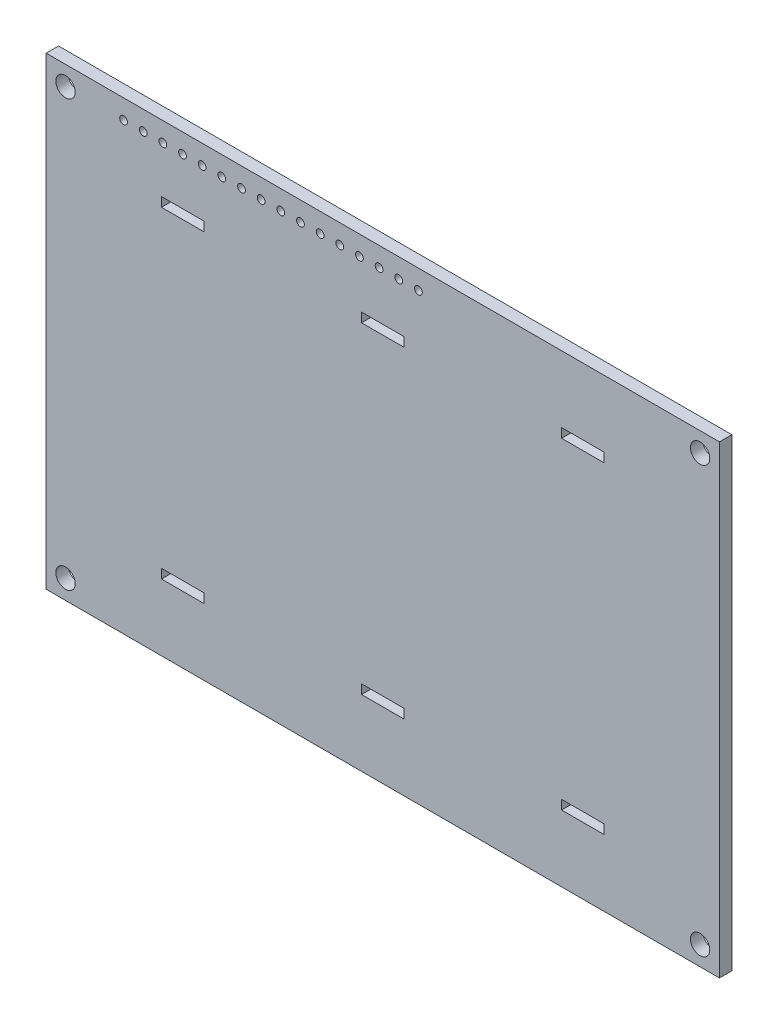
ISO-10303-21;
HEADER;
FILE_DESCRIPTION(('STEP AP214'),'2;1');
FILE_NAME('part.step','',(''),(''),'','','');
FILE_SCHEMA(('AUTOMOTIVE_DESIGN { 1 0 10303 214 1 1 1 1 }'));
ENDSEC;
DATA;
#1=APPLICATION_CONTEXT('core data for automotive mechanical design processes');
#2=APPLICATION_PROTOCOL_DEFINITION('international standard','automotive_design',2000,#1);
#3=PRODUCT_CONTEXT('',#1,'mechanical');
#4=PRODUCT('Part','Part','',(#3));
#5=PRODUCT_RELATED_PRODUCT_CATEGORY('part','',(#4));
#6=PRODUCT_DEFINITION_FORMATION('','',#4);
#7=PRODUCT_DEFINITION_CONTEXT('part definition',#1,'design');
#8=PRODUCT_DEFINITION('design','',#6,#7);
#9=PRODUCT_DEFINITION_SHAPE('','',#8);
#10=(LENGTH_UNIT() NAMED_UNIT(*) SI_UNIT(.MILLI.,.METRE.));
#11=(NAMED_UNIT(*) PLANE_ANGLE_UNIT() SI_UNIT($,.RADIAN.));
#12=(NAMED_UNIT(*) SI_UNIT($,.STERADIAN.) SOLID_ANGLE_UNIT());
#13=UNCERTAINTY_MEASURE_WITH_UNIT(LENGTH_MEASURE(1.E-05),#10,'distance_accuracy_value','');
#14=(GEOMETRIC_REPRESENTATION_CONTEXT(3) GLOBAL_UNCERTAINTY_ASSIGNED_CONTEXT((#13)) GLOBAL_UNIT_ASSIGNED_CONTEXT((#10,
#11,#12)) REPRESENTATION_CONTEXT('',''));
#15=CARTESIAN_POINT('',(0.,0.,0.));
#16=DIRECTION('',(0.,0.,1.));
#17=DIRECTION('',(1.,0.,0.));
#18=AXIS2_PLACEMENT_3D('',#15,#16,#17);
#19=CARTESIAN_POINT('',(0.,59.99999938,0.));
#20=DIRECTION('',(0.,0.,1.));
#21=DIRECTION('',(1.,0.,0.));
#22=AXIS2_PLACEMENT_3D('',#19,#20,#21);
#23=PLANE('',#22);
#24=CARTESIAN_POINT('',(43.02000032,57.4999993,0.));
#25=DIRECTION('',(0.,0.,-1.));
#26=DIRECTION('',(-1.,0.,0.));
#27=AXIS2_PLACEMENT_3D('',#24,#25,#26);
#28=CIRCLE('',#27,0.499999);
#29=CARTESIAN_POINT('',(42.52000132,57.4999993,0.));
#30=VERTEX_POINT('',#29);
#31=EDGE_CURVE('E294',#30,#30,#28,.T.);
#32=ORIENTED_EDGE('',*,*,#31,.T.);
#33=EDGE_LOOP('',(#32));
#34=FACE_BOUND('',#33,.T.);
#35=CARTESIAN_POINT('',(40.48000032,57.4999993,0.));
#36=DIRECTION('',(0.,0.,-1.));
#37=DIRECTION('',(-1.,0.,0.));
#38=AXIS2_PLACEMENT_3D('',#35,#36,#37);
#39=CIRCLE('',#38,0.499999);
#40=CARTESIAN_POINT('',(39.98000132,57.4999993,0.));
#41=VERTEX_POINT('',#40);
#42=EDGE_CURVE('E297',#41,#41,#39,.T.);
#43=ORIENTED_EDGE('',*,*,#42,.T.);
#44=EDGE_LOOP('',(#43));
#45=FACE_BOUND('',#44,.T.);
#46=CARTESIAN_POINT('',(48.10000032,57.4999993,0.));
#47=DIRECTION('',(0.,0.,-1.));
#48=DIRECTION('',(-1.,0.,0.));
#49=AXIS2_PLACEMENT_3D('',#46,#47,#48);
#50=CIRCLE('',#49,0.499999);
#51=CARTESIAN_POINT('',(47.60000132,57.4999993,0.));
#52=VERTEX_POINT('',#51);
#53=EDGE_CURVE('E300',#52,#52,#50,.T.);
#54=ORIENTED_EDGE('',*,*,#53,.T.);
#55=EDGE_LOOP('',(#54));
#56=FACE_BOUND('',#55,.T.);
#57=CARTESIAN_POINT('',(45.56000032,57.4999993,0.));
#58=DIRECTION('',(0.,0.,-1.));
#59=DIRECTION('',(-1.,0.,0.));
#60=AXIS2_PLACEMENT_3D('',#57,#58,#59);
#61=CIRCLE('',#60,0.499999);
#62=CARTESIAN_POINT('',(45.06000132,57.4999993,0.));
#63=VERTEX_POINT('',#62);
#64=EDGE_CURVE('E303',#63,#63,#61,.T.);
#65=ORIENTED_EDGE('',*,*,#64,.T.);
#66=EDGE_LOOP('',(#65));
#67=FACE_BOUND('',#66,.T.);
#68=CARTESIAN_POINT('',(35.40000032,57.4999993,0.));
#69=DIRECTION('',(0.,0.,-1.));
#70=DIRECTION('',(-1.,0.,0.));
#71=AXIS2_PLACEMENT_3D('',#68,#69,#70);
#72=CIRCLE('',#71,0.499999);
#73=CARTESIAN_POINT('',(34.90000132,57.4999993,0.));
#74=VERTEX_POINT('',#73);
#75=EDGE_CURVE('E306',#74,#74,#72,.T.);
#76=ORIENTED_EDGE('',*,*,#75,.T.);
#77=EDGE_LOOP('',(#76));
#78=FACE_BOUND('',#77,.T.);
#79=CARTESIAN_POINT('',(32.86000032,57.4999993,0.));
#80=DIRECTION('',(0.,0.,-1.));
#81=DIRECTION('',(-1.,0.,0.));
#82=AXIS2_PLACEMENT_3D('',#79,#80,#81);
#83=CIRCLE('',#82,0.499999);
#84=CARTESIAN_POINT('',(32.36000132,57.4999993,0.));
#85=VERTEX_POINT('',#84);
#86=EDGE_CURVE('E309',#85,#85,#83,.T.);
#87=ORIENTED_EDGE('',*,*,#86,.T.);
#88=EDGE_LOOP('',(#87));
#89=FACE_BOUND('',#88,.T.);
#90=CARTESIAN_POINT('',(37.94000032,57.4999993,0.));
#91=DIRECTION('',(0.,0.,-1.));
#92=DIRECTION('',(-1.,0.,0.));
#93=AXIS2_PLACEMENT_3D('',#90,#91,#92);
#94=CIRCLE('',#93,0.499999);
#95=CARTESIAN_POINT('',(37.44000132,57.4999993,0.));
#96=VERTEX_POINT('',#95);
#97=EDGE_CURVE('E312',#96,#96,#94,.T.);
#98=ORIENTED_EDGE('',*,*,#97,.T.);
#99=EDGE_LOOP('',(#98));
#100=FACE_BOUND('',#99,.T.);
#101=CARTESIAN_POINT('',(84.50000118,57.4999993,0.));
#102=DIRECTION('',(0.,0.,-1.));
#103=DIRECTION('',(-1.,0.,0.));
#104=AXIS2_PLACEMENT_3D('',#101,#102,#103);
#105=CIRCLE('',#104,1.25000004);
#106=CARTESIAN_POINT('',(83.25000114,57.4999993,0.));
#107=VERTEX_POINT('',#106);
#108=EDGE_CURVE('E315',#107,#107,#105,.T.);
#109=ORIENTED_EDGE('',*,*,#108,.T.);
#110=EDGE_LOOP('',(#109));
#111=FACE_BOUND('',#110,.T.);
#112=DIRECTION('',(1.,0.,0.));
#113=VECTOR('',#112,1.);
#114=CARTESIAN_POINT('',(66.60000142,9.79999818,0.));
#115=LINE('',#114,#113);
#116=CARTESIAN_POINT('',(66.60000142,9.79999818,0.));
#117=VERTEX_POINT('',#116);
#118=CARTESIAN_POINT('',(72.10000058,9.79999818,0.));
#119=VERTEX_POINT('',#118);
#120=EDGE_CURVE('E390',#117,#119,#115,.T.);
#121=ORIENTED_EDGE('',*,*,#120,.T.);
#122=DIRECTION('',(0.,1.,0.));
#123=VECTOR('',#122,1.);
#124=CARTESIAN_POINT('',(72.10000058,9.79999818,0.));
#125=LINE('',#124,#123);
#126=CARTESIAN_POINT('',(72.10000058,8.60000058,0.));
#127=VERTEX_POINT('',#126);
#128=EDGE_CURVE('E386',#119,#127,#125,.F.);
#129=ORIENTED_EDGE('',*,*,#128,.T.);
#130=DIRECTION('',(1.,0.,0.));
#131=VECTOR('',#130,1.);
#132=CARTESIAN_POINT('',(72.10000058,8.60000058,0.));
#133=LINE('',#132,#131);
#134=CARTESIAN_POINT('',(66.60000142,8.60000058,0.));
#135=VERTEX_POINT('',#134);
#136=EDGE_CURVE('E322',#127,#135,#133,.F.);
#137=ORIENTED_EDGE('',*,*,#136,.T.);
#138=DIRECTION('',(0.,1.,0.));
#139=VECTOR('',#138,1.);
#140=CARTESIAN_POINT('',(66.60000142,8.60000058,0.));
#141=LINE('',#140,#139);
#142=EDGE_CURVE('E395',#135,#117,#141,.T.);
#143=ORIENTED_EDGE('',*,*,#142,.T.);
#144=EDGE_LOOP('',(#121,#129,#137,#143));
#145=FACE_BOUND('',#144,.T.);
#146=CARTESIAN_POINT('',(84.50000118,2.50000008,0.));
#147=DIRECTION('',(0.,0.,-1.));
#148=DIRECTION('',(-1.,0.,0.));
#149=AXIS2_PLACEMENT_3D('',#146,#147,#148);
#150=CIRCLE('',#149,1.25000004);
#151=CARTESIAN_POINT('',(83.25000114,2.50000008,0.));
#152=VERTEX_POINT('',#151);
#153=EDGE_CURVE('E319',#152,#152,#150,.T.);
#154=ORIENTED_EDGE('',*,*,#153,.T.);
#155=EDGE_LOOP('',(#154));
#156=FACE_BOUND('',#155,.T.);
#157=DIRECTION('',(1.,0.,0.));
#158=VECTOR('',#157,1.);
#159=CARTESIAN_POINT('',(66.5999938,51.3999988,0.));
#160=LINE('',#159,#158);
#161=CARTESIAN_POINT('',(66.5999938,51.3999988,0.));
#162=VERTEX_POINT('',#161);
#163=CARTESIAN_POINT('',(72.09999296,51.3999988,0.));
#164=VERTEX_POINT('',#163);
#165=EDGE_CURVE('E409',#162,#164,#160,.T.);
#166=ORIENTED_EDGE('',*,*,#165,.T.);
#167=DIRECTION('',(0.,1.,0.));
#168=VECTOR('',#167,1.);
#169=CARTESIAN_POINT('',(72.09999296,51.3999988,0.));
#170=LINE('',#169,#168);
#171=CARTESIAN_POINT('',(72.09999296,50.2000012,0.));
#172=VERTEX_POINT('',#171);
#173=EDGE_CURVE('E403',#164,#172,#170,.F.);
#174=ORIENTED_EDGE('',*,*,#173,.T.);
#175=DIRECTION('',(1.,0.,0.));
#176=VECTOR('',#175,1.);
#177=CARTESIAN_POINT('',(72.09999296,50.2000012,0.));
#178=LINE('',#177,#176);
#179=CARTESIAN_POINT('',(66.5999938,50.2000012,0.));
#180=VERTEX_POINT('',#179);
#181=EDGE_CURVE('E419',#172,#180,#178,.F.);
#182=ORIENTED_EDGE('',*,*,#181,.T.);
#183=DIRECTION('',(0.,1.,0.));
#184=VECTOR('',#183,1.);
#185=CARTESIAN_POINT('',(66.5999938,50.2000012,0.));
#186=LINE('',#185,#184);
#187=EDGE_CURVE('E414',#180,#162,#186,.T.);
#188=ORIENTED_EDGE('',*,*,#187,.T.);
#189=EDGE_LOOP('',(#166,#174,#182,#188));
#190=FACE_BOUND('',#189,.T.);
#191=DIRECTION('',(1.,0.,0.));
#192=VECTOR('',#191,1.);
#193=CARTESIAN_POINT('',(40.75000232,51.3999988,0.));
#194=LINE('',#193,#192);
#195=CARTESIAN_POINT('',(40.75000232,51.3999988,0.));
#196=VERTEX_POINT('',#195);
#197=CARTESIAN_POINT('',(46.25000148,51.3999988,0.));
#198=VERTEX_POINT('',#197);
#199=EDGE_CURVE('E430',#196,#198,#194,.T.);
#200=ORIENTED_EDGE('',*,*,#199,.T.);
#201=DIRECTION('',(0.,1.,0.));
#202=VECTOR('',#201,1.);
#203=CARTESIAN_POINT('',(46.25000148,51.3999988,0.));
#204=LINE('',#203,#202);
#205=CARTESIAN_POINT('',(46.25000148,50.2000012,0.));
#206=VERTEX_POINT('',#205);
#207=EDGE_CURVE('E424',#198,#206,#204,.F.);
#208=ORIENTED_EDGE('',*,*,#207,.T.);
#209=DIRECTION('',(1.,0.,0.));
#210=VECTOR('',#209,1.);
#211=CARTESIAN_POINT('',(46.25000148,50.2000012,0.));
#212=LINE('',#211,#210);
#213=CARTESIAN_POINT('',(40.75000232,50.2000012,0.));
#214=VERTEX_POINT('',#213);
#215=EDGE_CURVE('E440',#206,#214,#212,.F.);
#216=ORIENTED_EDGE('',*,*,#215,.T.);
#217=DIRECTION('',(0.,1.,0.));
#218=VECTOR('',#217,1.);
#219=CARTESIAN_POINT('',(40.75000232,50.2000012,0.));
#220=LINE('',#219,#218);
#221=EDGE_CURVE('E435',#214,#196,#220,.T.);
#222=ORIENTED_EDGE('',*,*,#221,.T.);
#223=EDGE_LOOP('',(#200,#208,#216,#222));
#224=FACE_BOUND('',#223,.T.);
#225=DIRECTION('',(1.,0.,0.));
#226=VECTOR('',#225,1.);
#227=CARTESIAN_POINT('',(40.75000994,9.79999818,0.));
#228=LINE('',#227,#226);
#229=CARTESIAN_POINT('',(40.75000994,9.79999818,0.));
#230=VERTEX_POINT('',#229);
#231=CARTESIAN_POINT('',(46.2500091,9.79999818,0.));
#232=VERTEX_POINT('',#231);
#233=EDGE_CURVE('E451',#230,#232,#228,.T.);
#234=ORIENTED_EDGE('',*,*,#233,.T.);
#235=DIRECTION('',(0.,1.,0.));
#236=VECTOR('',#235,1.);
#237=CARTESIAN_POINT('',(46.2500091,9.79999818,0.));
#238=LINE('',#237,#236);
#239=CARTESIAN_POINT('',(46.2500091,8.60000058,0.));
#240=VERTEX_POINT('',#239);
#241=EDGE_CURVE('E445',#232,#240,#238,.F.);
#242=ORIENTED_EDGE('',*,*,#241,.T.);
#243=DIRECTION('',(1.,0.,0.));
#244=VECTOR('',#243,1.);
#245=CARTESIAN_POINT('',(46.2500091,8.60000058,0.));
#246=LINE('',#245,#244);
#247=CARTESIAN_POINT('',(40.75000994,8.60000058,0.));
#248=VERTEX_POINT('',#247);
#249=EDGE_CURVE('E327',#240,#248,#246,.F.);
#250=ORIENTED_EDGE('',*,*,#249,.T.);
#251=DIRECTION('',(0.,1.,0.));
#252=VECTOR('',#251,1.);
#253=CARTESIAN_POINT('',(40.75000994,8.60000058,0.));
#254=LINE('',#253,#252);
#255=EDGE_CURVE('E456',#248,#230,#254,.T.);
#256=ORIENTED_EDGE('',*,*,#255,.T.);
#257=EDGE_LOOP('',(#234,#242,#250,#256));
#258=FACE_BOUND('',#257,.T.);
#259=CARTESIAN_POINT('',(25.24000032,57.4999993,0.));
#260=DIRECTION('',(0.,0.,-1.));
#261=DIRECTION('',(-1.,0.,0.));
#262=AXIS2_PLACEMENT_3D('',#259,#260,#261);
#263=CIRCLE('',#262,0.499999);
#264=CARTESIAN_POINT('',(24.74000132,57.4999993,0.));
#265=VERTEX_POINT('',#264);
#266=EDGE_CURVE('E324',#265,#265,#263,.T.);
#267=ORIENTED_EDGE('',*,*,#266,.T.);
#268=EDGE_LOOP('',(#267));
#269=FACE_BOUND('',#268,.T.);
#270=CARTESIAN_POINT('',(22.70000032,57.4999993,0.));
#271=DIRECTION('',(0.,0.,-1.));
#272=DIRECTION('',(-1.,0.,0.));
#273=AXIS2_PLACEMENT_3D('',#270,#271,#272);
#274=CIRCLE('',#273,0.499999);
#275=CARTESIAN_POINT('',(22.20000132,57.4999993,0.));
#276=VERTEX_POINT('',#275);
#277=EDGE_CURVE('E328',#276,#276,#274,.T.);
#278=ORIENTED_EDGE('',*,*,#277,.T.);
#279=EDGE_LOOP('',(#278));
#280=FACE_BOUND('',#279,.T.);
#281=CARTESIAN_POINT('',(30.32000032,57.4999993,0.));
#282=DIRECTION('',(0.,0.,-1.));
#283=DIRECTION('',(-1.,0.,0.));
#284=AXIS2_PLACEMENT_3D('',#281,#282,#283);
#285=CIRCLE('',#284,0.499999);
#286=CARTESIAN_POINT('',(29.82000132,57.4999993,0.));
#287=VERTEX_POINT('',#286);
#288=EDGE_CURVE('E331',#287,#287,#285,.T.);
#289=ORIENTED_EDGE('',*,*,#288,.T.);
#290=EDGE_LOOP('',(#289));
#291=FACE_BOUND('',#290,.T.);
#292=CARTESIAN_POINT('',(27.78000032,57.4999993,0.));
#293=DIRECTION('',(0.,0.,-1.));
#294=DIRECTION('',(-1.,0.,0.));
#295=AXIS2_PLACEMENT_3D('',#292,#293,#294);
#296=CIRCLE('',#295,0.499999);
#297=CARTESIAN_POINT('',(27.28000132,57.4999993,0.));
#298=VERTEX_POINT('',#297);
#299=EDGE_CURVE('E334',#298,#298,#296,.T.);
#300=ORIENTED_EDGE('',*,*,#299,.T.);
#301=EDGE_LOOP('',(#300));
#302=FACE_BOUND('',#301,.T.);
#303=CARTESIAN_POINT('',(17.62000032,57.4999993,0.));
#304=DIRECTION('',(0.,0.,-1.));
#305=DIRECTION('',(-1.,0.,0.));
#306=AXIS2_PLACEMENT_3D('',#303,#304,#305);
#307=CIRCLE('',#306,0.499999);
#308=CARTESIAN_POINT('',(17.12000132,57.4999993,0.));
#309=VERTEX_POINT('',#308);
#310=EDGE_CURVE('E337',#309,#309,#307,.T.);
#311=ORIENTED_EDGE('',*,*,#310,.T.);
#312=EDGE_LOOP('',(#311));
#313=FACE_BOUND('',#312,.T.);
#314=CARTESIAN_POINT('',(10.00000032,57.4999993,0.));
#315=DIRECTION('',(0.,0.,-1.));
#316=DIRECTION('',(-1.,0.,0.));
#317=AXIS2_PLACEMENT_3D('',#314,#315,#316);
#318=CIRCLE('',#317,0.499999);
#319=CARTESIAN_POINT('',(9.50000132,57.4999993,0.));
#320=VERTEX_POINT('',#319);
#321=EDGE_CURVE('E340',#320,#320,#318,.T.);
#322=ORIENTED_EDGE('',*,*,#321,.T.);
#323=EDGE_LOOP('',(#322));
#324=FACE_BOUND('',#323,.T.);
#325=CARTESIAN_POINT('',(20.16000032,57.4999993,0.));
#326=DIRECTION('',(0.,0.,-1.));
#327=DIRECTION('',(-1.,0.,0.));
#328=AXIS2_PLACEMENT_3D('',#325,#326,#327);
#329=CIRCLE('',#328,0.499999);
#330=CARTESIAN_POINT('',(19.66000132,57.4999993,0.));
#331=VERTEX_POINT('',#330);
#332=EDGE_CURVE('E343',#331,#331,#329,.T.);
#333=ORIENTED_EDGE('',*,*,#332,.T.);
#334=EDGE_LOOP('',(#333));
#335=FACE_BOUND('',#334,.T.);
#336=DIRECTION('',(1.,0.,0.));
#337=VECTOR('',#336,1.);
#338=CARTESIAN_POINT('',(14.90000068,51.3999988,0.));
#339=LINE('',#338,#337);
#340=CARTESIAN_POINT('',(14.90000068,51.3999988,0.));
#341=VERTEX_POINT('',#340);
#342=CARTESIAN_POINT('',(20.39999984,51.3999988,0.));
#343=VERTEX_POINT('',#342);
#344=EDGE_CURVE('E470',#341,#343,#339,.T.);
#345=ORIENTED_EDGE('',*,*,#344,.T.);
#346=DIRECTION('',(0.,1.,0.));
#347=VECTOR('',#346,1.);
#348=CARTESIAN_POINT('',(20.39999984,51.3999988,0.));
#349=LINE('',#348,#347);
#350=CARTESIAN_POINT('',(20.39999984,50.2000012,0.));
#351=VERTEX_POINT('',#350);
#352=EDGE_CURVE('E464',#343,#351,#349,.F.);
#353=ORIENTED_EDGE('',*,*,#352,.T.);
#354=DIRECTION('',(1.,0.,0.));
#355=VECTOR('',#354,1.);
#356=CARTESIAN_POINT('',(20.39999984,50.2000012,0.));
#357=LINE('',#356,#355);
#358=CARTESIAN_POINT('',(14.90000068,50.2000012,0.));
#359=VERTEX_POINT('',#358);
#360=EDGE_CURVE('E350',#351,#359,#357,.F.);
#361=ORIENTED_EDGE('',*,*,#360,.T.);
#362=DIRECTION('',(0.,1.,0.));
#363=VECTOR('',#362,1.);
#364=CARTESIAN_POINT('',(14.90000068,50.2000012,0.));
#365=LINE('',#364,#363);
#366=EDGE_CURVE('E475',#359,#341,#365,.T.);
#367=ORIENTED_EDGE('',*,*,#366,.T.);
#368=EDGE_LOOP('',(#345,#353,#361,#367));
#369=FACE_BOUND('',#368,.T.);
#370=CARTESIAN_POINT('',(15.08000032,57.4999993,0.));
#371=DIRECTION('',(0.,0.,-1.));
#372=DIRECTION('',(-1.,0.,0.));
#373=AXIS2_PLACEMENT_3D('',#370,#371,#372);
#374=CIRCLE('',#373,0.499999);
#375=CARTESIAN_POINT('',(14.58000132,57.4999993,0.));
#376=VERTEX_POINT('',#375);
#377=EDGE_CURVE('E347',#376,#376,#374,.T.);
#378=ORIENTED_EDGE('',*,*,#377,.T.);
#379=EDGE_LOOP('',(#378));
#380=FACE_BOUND('',#379,.T.);
#381=DIRECTION('',(1.,0.,0.));
#382=VECTOR('',#381,1.);
#383=CARTESIAN_POINT('',(14.9000083,9.79999818,0.));
#384=LINE('',#383,#382);
#385=CARTESIAN_POINT('',(14.9000083,9.79999818,0.));
#386=VERTEX_POINT('',#385);
#387=CARTESIAN_POINT('',(20.40000746,9.79999818,0.));
#388=VERTEX_POINT('',#387);
#389=EDGE_CURVE('E489',#386,#388,#384,.T.);
#390=ORIENTED_EDGE('',*,*,#389,.T.);
#391=DIRECTION('',(0.,1.,0.));
#392=VECTOR('',#391,1.);
#393=CARTESIAN_POINT('',(20.40000746,9.79999818,0.));
#394=LINE('',#393,#392);
#395=CARTESIAN_POINT('',(20.40000746,8.60000058,0.));
#396=VERTEX_POINT('',#395);
#397=EDGE_CURVE('E483',#388,#396,#394,.F.);
#398=ORIENTED_EDGE('',*,*,#397,.T.);
#399=DIRECTION('',(1.,0.,0.));
#400=VECTOR('',#399,1.);
#401=CARTESIAN_POINT('',(20.40000746,8.60000058,0.));
#402=LINE('',#401,#400);
#403=CARTESIAN_POINT('',(14.9000083,8.60000058,0.));
#404=VERTEX_POINT('',#403);
#405=EDGE_CURVE('E354',#396,#404,#402,.F.);
#406=ORIENTED_EDGE('',*,*,#405,.T.);
#407=DIRECTION('',(0.,1.,0.));
#408=VECTOR('',#407,1.);
#409=CARTESIAN_POINT('',(14.9000083,8.60000058,0.));
#410=LINE('',#409,#408);
#411=EDGE_CURVE('E494',#404,#386,#410,.T.);
#412=ORIENTED_EDGE('',*,*,#411,.T.);
#413=EDGE_LOOP('',(#390,#398,#406,#412));
#414=FACE_BOUND('',#413,.T.);
#415=CARTESIAN_POINT('',(12.54000032,57.4999993,0.));
#416=DIRECTION('',(0.,0.,-1.));
#417=DIRECTION('',(-1.,0.,0.));
#418=AXIS2_PLACEMENT_3D('',#415,#416,#417);
#419=CIRCLE('',#418,0.499999);
#420=CARTESIAN_POINT('',(12.04000132,57.4999993,0.));
#421=VERTEX_POINT('',#420);
#422=EDGE_CURVE('E352',#421,#421,#419,.T.);
#423=ORIENTED_EDGE('',*,*,#422,.T.);
#424=EDGE_LOOP('',(#423));
#425=FACE_BOUND('',#424,.T.);
#426=CARTESIAN_POINT('',(2.50000008,57.4999993,0.));
#427=DIRECTION('',(0.,0.,-1.));
#428=DIRECTION('',(-1.,0.,0.));
#429=AXIS2_PLACEMENT_3D('',#426,#427,#428);
#430=CIRCLE('',#429,1.25000004);
#431=CARTESIAN_POINT('',(1.25000004,57.4999993,0.));
#432=VERTEX_POINT('',#431);
#433=EDGE_CURVE('E355',#432,#432,#430,.T.);
#434=ORIENTED_EDGE('',*,*,#433,.T.);
#435=EDGE_LOOP('',(#434));
#436=FACE_BOUND('',#435,.T.);
#437=CARTESIAN_POINT('',(2.50000008,2.50000008,0.));
#438=DIRECTION('',(0.,0.,-1.));
#439=DIRECTION('',(-1.,0.,0.));
#440=AXIS2_PLACEMENT_3D('',#437,#438,#439);
#441=CIRCLE('',#440,1.25000004);
#442=CARTESIAN_POINT('',(1.25000004,2.50000008,0.));
#443=VERTEX_POINT('',#442);
#444=EDGE_CURVE('E20',#443,#443,#441,.T.);
#445=ORIENTED_EDGE('',*,*,#444,.T.);
#446=EDGE_LOOP('',(#445));
#447=FACE_BOUND('',#446,.T.);
#448=DIRECTION('',(1.,0.,0.));
#449=VECTOR('',#448,1.);
#450=CARTESIAN_POINT('',(87.00000126,0.,0.));
#451=LINE('',#450,#449);
#452=CARTESIAN_POINT('',(87.00000126,0.,0.));
#453=VERTEX_POINT('',#452);
#454=CARTESIAN_POINT('',(0.,0.,0.));
#455=VERTEX_POINT('',#454);
#456=EDGE_CURVE('E200',#453,#455,#451,.F.);
#457=ORIENTED_EDGE('',*,*,#456,.F.);
#458=DIRECTION('',(0.,1.,0.));
#459=VECTOR('',#458,1.);
#460=CARTESIAN_POINT('',(87.00000126,59.99999938,0.));
#461=LINE('',#460,#459);
#462=CARTESIAN_POINT('',(87.00000126,59.99999938,0.));
#463=VERTEX_POINT('',#462);
#464=EDGE_CURVE('E217',#463,#453,#461,.F.);
#465=ORIENTED_EDGE('',*,*,#464,.F.);
#466=DIRECTION('',(1.,0.,0.));
#467=VECTOR('',#466,1.);
#468=CARTESIAN_POINT('',(0.,59.99999938,0.));
#469=LINE('',#468,#467);
#470=CARTESIAN_POINT('',(0.,59.99999938,0.));
#471=VERTEX_POINT('',#470);
#472=EDGE_CURVE('E214',#471,#463,#469,.T.);
#473=ORIENTED_EDGE('',*,*,#472,.F.);
#474=DIRECTION('',(0.,1.,0.));
#475=VECTOR('',#474,1.);
#476=CARTESIAN_POINT('',(0.,0.,0.));
#477=LINE('',#476,#475);
#478=EDGE_CURVE('E205',#455,#471,#477,.T.);
#479=ORIENTED_EDGE('',*,*,#478,.F.);
#480=EDGE_LOOP('',(#457,#465,#473,#479));
#481=FACE_BOUND('',#480,.T.);
#482=ADVANCED_FACE('F17',(#34,#45,#56,#67,#78,#89,#100,#111,#145,#156,#190,#224,#258,#269,#280,
#291,#302,#313,#324,#335,#369,#380,#414,#425,#436,#447,#481),#23,.T.);
#483=CARTESIAN_POINT('',(0.,59.99999938,-1.59999934));
#484=DIRECTION('',(0.,1.,0.));
#485=DIRECTION('',(0.,0.,1.));
#486=AXIS2_PLACEMENT_3D('',#483,#484,#485);
#487=PLANE('',#486);
#488=DIRECTION('',(0.,0.,-1.));
#489=VECTOR('',#488,1.);
#490=CARTESIAN_POINT('',(87.00000126,59.99999938,-1.59999934));
#491=LINE('',#490,#489);
#492=CARTESIAN_POINT('',(87.00000126,59.99999938,-1.59999934));
#493=VERTEX_POINT('',#492);
#494=EDGE_CURVE('E367',#493,#463,#491,.F.);
#495=ORIENTED_EDGE('',*,*,#494,.F.);
#496=DIRECTION('',(1.,0.,0.));
#497=VECTOR('',#496,1.);
#498=CARTESIAN_POINT('',(0.,59.99999938,-1.59999934));
#499=LINE('',#498,#497);
#500=CARTESIAN_POINT('',(0.,59.99999938,-1.59999934));
#501=VERTEX_POINT('',#500);
#502=EDGE_CURVE('E224',#493,#501,#499,.F.);
#503=ORIENTED_EDGE('',*,*,#502,.T.);
#504=DIRECTION('',(0.,0.,1.));
#505=VECTOR('',#504,1.);
#506=CARTESIAN_POINT('',(0.,59.99999938,-1.59999934));
#507=LINE('',#506,#505);
#508=EDGE_CURVE('E210',#471,#501,#507,.F.);
#509=ORIENTED_EDGE('',*,*,#508,.F.);
#510=ORIENTED_EDGE('',*,*,#472,.T.);
#511=EDGE_LOOP('',(#495,#503,#509,#510));
#512=FACE_BOUND('',#511,.T.);
#513=ADVANCED_FACE('F223',(#512),#487,.T.);
#514=CARTESIAN_POINT('',(0.,0.,-1.59999934));
#515=DIRECTION('',(-1.,0.,0.));
#516=DIRECTION('',(0.,0.,1.));
#517=AXIS2_PLACEMENT_3D('',#514,#515,#516);
#518=PLANE('',#517);
#519=ORIENTED_EDGE('',*,*,#508,.T.);
#520=DIRECTION('',(0.,1.,0.));
#521=VECTOR('',#520,1.);
#522=CARTESIAN_POINT('',(0.,59.99999938,-1.59999934));
#523=LINE('',#522,#521);
#524=CARTESIAN_POINT('',(0.,0.,-1.59999934));
#525=VERTEX_POINT('',#524);
#526=EDGE_CURVE('E378',#501,#525,#523,.F.);
#527=ORIENTED_EDGE('',*,*,#526,.T.);
#528=DIRECTION('',(0.,0.,-1.));
#529=VECTOR('',#528,1.);
#530=CARTESIAN_POINT('',(0.,0.,-1.59999934));
#531=LINE('',#530,#529);
#532=EDGE_CURVE('E212',#455,#525,#531,.T.);
#533=ORIENTED_EDGE('',*,*,#532,.F.);
#534=ORIENTED_EDGE('',*,*,#478,.T.);
#535=EDGE_LOOP('',(#519,#527,#533,#534));
#536=FACE_BOUND('',#535,.T.);
#537=ADVANCED_FACE('F207',(#536),#518,.T.);
#538=CARTESIAN_POINT('',(87.00000126,0.,-1.59999934));
#539=DIRECTION('',(0.,-1.,0.));
#540=DIRECTION('',(0.,0.,-1.));
#541=AXIS2_PLACEMENT_3D('',#538,#539,#540);
#542=PLANE('',#541);
#543=ORIENTED_EDGE('',*,*,#532,.T.);
#544=DIRECTION('',(1.,0.,0.));
#545=VECTOR('',#544,1.);
#546=CARTESIAN_POINT('',(0.,0.,-1.59999934));
#547=LINE('',#546,#545);
#548=CARTESIAN_POINT('',(87.00000126,0.,-1.59999934));
#549=VERTEX_POINT('',#548);
#550=EDGE_CURVE('E375',#525,#549,#547,.T.);
#551=ORIENTED_EDGE('',*,*,#550,.T.);
#552=DIRECTION('',(0.,0.,-1.));
#553=VECTOR('',#552,1.);
#554=CARTESIAN_POINT('',(87.00000126,0.,-1.59999934));
#555=LINE('',#554,#553);
#556=EDGE_CURVE('E360',#453,#549,#555,.T.);
#557=ORIENTED_EDGE('',*,*,#556,.F.);
#558=ORIENTED_EDGE('',*,*,#456,.T.);
#559=EDGE_LOOP('',(#543,#551,#557,#558));
#560=FACE_BOUND('',#559,.T.);
#561=ADVANCED_FACE('F374',(#560),#542,.T.);
#562=CARTESIAN_POINT('',(87.00000126,59.99999938,-1.59999934));
#563=DIRECTION('',(1.,0.,0.));
#564=DIRECTION('',(0.,0.,-1.));
#565=AXIS2_PLACEMENT_3D('',#562,#563,#564);
#566=PLANE('',#565);
#567=ORIENTED_EDGE('',*,*,#556,.T.);
#568=DIRECTION('',(0.,1.,0.));
#569=VECTOR('',#568,1.);
#570=CARTESIAN_POINT('',(87.00000126,59.99999938,-1.59999934));
#571=LINE('',#570,#569);
#572=EDGE_CURVE('E293',#549,#493,#571,.T.);
#573=ORIENTED_EDGE('',*,*,#572,.T.);
#574=ORIENTED_EDGE('',*,*,#494,.T.);
#575=ORIENTED_EDGE('',*,*,#464,.T.);
#576=EDGE_LOOP('',(#567,#573,#574,#575));
#577=FACE_BOUND('',#576,.T.);
#578=ADVANCED_FACE('F524',(#577),#566,.T.);
#579=CARTESIAN_POINT('',(2.50000008,2.50000008,-1.59999934));
#580=DIRECTION('',(0.,0.,-1.));
#581=DIRECTION('',(-1.,0.,0.));
#582=AXIS2_PLACEMENT_3D('',#579,#580,#581);
#583=CYLINDRICAL_SURFACE('',#582,1.25000004);
#584=CARTESIAN_POINT('',(2.50000008,2.50000008,-1.59999934));
#585=DIRECTION('',(0.,0.,-1.));
#586=DIRECTION('',(-1.,0.,0.));
#587=AXIS2_PLACEMENT_3D('',#584,#585,#586);
#588=CIRCLE('',#587,1.25000004);
#589=CARTESIAN_POINT('',(1.25000004,2.50000008,-1.59999934));
#590=VERTEX_POINT('',#589);
#591=EDGE_CURVE('E290',#590,#590,#588,.T.);
#592=ORIENTED_EDGE('',*,*,#591,.T.);
#593=EDGE_LOOP('',(#592));
#594=FACE_BOUND('',#593,.T.);
#595=ORIENTED_EDGE('',*,*,#444,.F.);
#596=EDGE_LOOP('',(#595));
#597=FACE_BOUND('',#596,.T.);
#598=ADVANCED_FACE('F526',(#594,#597),#583,.F.);
#599=CARTESIAN_POINT('',(2.50000008,57.4999993,-1.59999934));
#600=DIRECTION('',(0.,0.,-1.));
#601=DIRECTION('',(-1.,0.,0.));
#602=AXIS2_PLACEMENT_3D('',#599,#600,#601);
#603=CYLINDRICAL_SURFACE('',#602,1.25000004);
#604=CARTESIAN_POINT('',(2.50000008,57.4999993,-1.59999934));
#605=DIRECTION('',(0.,0.,-1.));
#606=DIRECTION('',(-1.,0.,0.));
#607=AXIS2_PLACEMENT_3D('',#604,#605,#606);
#608=CIRCLE('',#607,1.25000004);
#609=CARTESIAN_POINT('',(1.25000004,57.4999993,-1.59999934));
#610=VERTEX_POINT('',#609);
#611=EDGE_CURVE('E287',#610,#610,#608,.T.);
#612=ORIENTED_EDGE('',*,*,#611,.T.);
#613=EDGE_LOOP('',(#612));
#614=FACE_BOUND('',#613,.T.);
#615=ORIENTED_EDGE('',*,*,#433,.F.);
#616=EDGE_LOOP('',(#615));
#617=FACE_BOUND('',#616,.T.);
#618=ADVANCED_FACE('F533',(#614,#617),#603,.F.);
#619=CARTESIAN_POINT('',(12.54000032,57.4999993,-1.59999934));
#620=DIRECTION('',(0.,0.,-1.));
#621=DIRECTION('',(-1.,0.,0.));
#622=AXIS2_PLACEMENT_3D('',#619,#620,#621);
#623=CYLINDRICAL_SURFACE('',#622,0.499999);
#624=CARTESIAN_POINT('',(12.54000032,57.4999993,-1.59999934));
#625=DIRECTION('',(0.,0.,-1.));
#626=DIRECTION('',(-1.,0.,0.));
#627=AXIS2_PLACEMENT_3D('',#624,#625,#626);
#628=CIRCLE('',#627,0.499999);
#629=CARTESIAN_POINT('',(12.04000132,57.4999993,-1.59999934));
#630=VERTEX_POINT('',#629);
#631=EDGE_CURVE('E283',#630,#630,#628,.T.);
#632=ORIENTED_EDGE('',*,*,#631,.T.);
#633=EDGE_LOOP('',(#632));
#634=FACE_BOUND('',#633,.T.);
#635=ORIENTED_EDGE('',*,*,#422,.F.);
#636=EDGE_LOOP('',(#635));
#637=FACE_BOUND('',#636,.T.);
#638=ADVANCED_FACE('F703',(#634,#637),#623,.F.);
#639=CARTESIAN_POINT('',(20.40000746,8.60000058,-1.59999934));
#640=DIRECTION('',(0.,-1.,0.));
#641=DIRECTION('',(0.,0.,-1.));
#642=AXIS2_PLACEMENT_3D('',#639,#640,#641);
#643=PLANE('',#642);
#644=DIRECTION('',(0.,0.,1.));
#645=VECTOR('',#644,1.);
#646=CARTESIAN_POINT('',(14.9000083,8.60000058,-1.59999934));
#647=LINE('',#646,#645);
#648=CARTESIAN_POINT('',(14.9000083,8.60000058,-1.59999934));
#649=VERTEX_POINT('',#648);
#650=EDGE_CURVE('E495',#649,#404,#647,.T.);
#651=ORIENTED_EDGE('',*,*,#650,.T.);
#652=ORIENTED_EDGE('',*,*,#405,.F.);
#653=DIRECTION('',(0.,0.,-1.));
#654=VECTOR('',#653,1.);
#655=CARTESIAN_POINT('',(20.40000746,8.60000058,-1.59999934));
#656=LINE('',#655,#654);
#657=CARTESIAN_POINT('',(20.40000746,8.60000058,-1.59999934));
#658=VERTEX_POINT('',#657);
#659=EDGE_CURVE('E351',#396,#658,#656,.T.);
#660=ORIENTED_EDGE('',*,*,#659,.T.);
#661=DIRECTION('',(1.,0.,0.));
#662=VECTOR('',#661,1.);
#663=CARTESIAN_POINT('',(0.,8.60000058,-1.59999934));
#664=LINE('',#663,#662);
#665=EDGE_CURVE('E286',#658,#649,#664,.F.);
#666=ORIENTED_EDGE('',*,*,#665,.T.);
#667=EDGE_LOOP('',(#651,#652,#660,#666));
#668=FACE_BOUND('',#667,.T.);
#669=ADVANCED_FACE('F700',(#668),#643,.F.);
#670=CARTESIAN_POINT('',(14.9000083,8.60000058,-1.59999934));
#671=DIRECTION('',(-1.,0.,0.));
#672=DIRECTION('',(0.,0.,1.));
#673=AXIS2_PLACEMENT_3D('',#670,#671,#672);
#674=PLANE('',#673);
#675=DIRECTION('',(0.,0.,1.));
#676=VECTOR('',#675,1.);
#677=CARTESIAN_POINT('',(14.9000083,9.79999818,-1.59999934));
#678=LINE('',#677,#676);
#679=CARTESIAN_POINT('',(14.9000083,9.79999818,-1.59999934));
#680=VERTEX_POINT('',#679);
#681=EDGE_CURVE('E491',#680,#386,#678,.T.);
#682=ORIENTED_EDGE('',*,*,#681,.T.);
#683=ORIENTED_EDGE('',*,*,#411,.F.);
#684=ORIENTED_EDGE('',*,*,#650,.F.);
#685=DIRECTION('',(0.,1.,0.));
#686=VECTOR('',#685,1.);
#687=CARTESIAN_POINT('',(14.9000083,59.99999938,-1.59999934));
#688=LINE('',#687,#686);
#689=EDGE_CURVE('E509',#649,#680,#688,.T.);
#690=ORIENTED_EDGE('',*,*,#689,.T.);
#691=EDGE_LOOP('',(#682,#683,#684,#690));
#692=FACE_BOUND('',#691,.T.);
#693=ADVANCED_FACE('F506',(#692),#674,.F.);
#694=CARTESIAN_POINT('',(14.9000083,9.79999818,-1.59999934));
#695=DIRECTION('',(0.,1.,0.));
#696=DIRECTION('',(0.,0.,1.));
#697=AXIS2_PLACEMENT_3D('',#694,#695,#696);
#698=PLANE('',#697);
#699=DIRECTION('',(0.,0.,-1.));
#700=VECTOR('',#699,1.);
#701=CARTESIAN_POINT('',(20.40000746,9.79999818,-1.59999934));
#702=LINE('',#701,#700);
#703=CARTESIAN_POINT('',(20.40000746,9.79999818,-1.59999934));
#704=VERTEX_POINT('',#703);
#705=EDGE_CURVE('E486',#704,#388,#702,.F.);
#706=ORIENTED_EDGE('',*,*,#705,.T.);
#707=ORIENTED_EDGE('',*,*,#389,.F.);
#708=ORIENTED_EDGE('',*,*,#681,.F.);
#709=DIRECTION('',(1.,0.,0.));
#710=VECTOR('',#709,1.);
#711=CARTESIAN_POINT('',(0.,9.79999818,-1.59999934));
#712=LINE('',#711,#710);
#713=EDGE_CURVE('E514',#680,#704,#712,.T.);
#714=ORIENTED_EDGE('',*,*,#713,.T.);
#715=EDGE_LOOP('',(#706,#707,#708,#714));
#716=FACE_BOUND('',#715,.T.);
#717=ADVANCED_FACE('F513',(#716),#698,.F.);
#718=CARTESIAN_POINT('',(20.40000746,9.79999818,-1.59999934));
#719=DIRECTION('',(1.,0.,0.));
#720=DIRECTION('',(0.,0.,-1.));
#721=AXIS2_PLACEMENT_3D('',#718,#719,#720);
#722=PLANE('',#721);
#723=ORIENTED_EDGE('',*,*,#659,.F.);
#724=ORIENTED_EDGE('',*,*,#397,.F.);
#725=ORIENTED_EDGE('',*,*,#705,.F.);
#726=DIRECTION('',(0.,1.,0.));
#727=VECTOR('',#726,1.);
#728=CARTESIAN_POINT('',(20.40000746,59.99999938,-1.59999934));
#729=LINE('',#728,#727);
#730=EDGE_CURVE('E282',#704,#658,#729,.F.);
#731=ORIENTED_EDGE('',*,*,#730,.T.);
#732=EDGE_LOOP('',(#723,#724,#725,#731));
#733=FACE_BOUND('',#732,.T.);
#734=ADVANCED_FACE('F691',(#733),#722,.F.);
#735=CARTESIAN_POINT('',(15.08000032,57.4999993,-1.59999934));
#736=DIRECTION('',(0.,0.,-1.));
#737=DIRECTION('',(-1.,0.,0.));
#738=AXIS2_PLACEMENT_3D('',#735,#736,#737);
#739=CYLINDRICAL_SURFACE('',#738,0.499999);
#740=CARTESIAN_POINT('',(15.08000032,57.4999993,-1.59999934));
#741=DIRECTION('',(0.,0.,-1.));
#742=DIRECTION('',(-1.,0.,0.));
#743=AXIS2_PLACEMENT_3D('',#740,#741,#742);
#744=CIRCLE('',#743,0.499999);
#745=CARTESIAN_POINT('',(14.58000132,57.4999993,-1.59999934));
#746=VERTEX_POINT('',#745);
#747=EDGE_CURVE('E278',#746,#746,#744,.T.);
#748=ORIENTED_EDGE('',*,*,#747,.T.);
#749=EDGE_LOOP('',(#748));
#750=FACE_BOUND('',#749,.T.);
#751=ORIENTED_EDGE('',*,*,#377,.F.);
#752=EDGE_LOOP('',(#751));
#753=FACE_BOUND('',#752,.T.);
#754=ADVANCED_FACE('F687',(#750,#753),#739,.F.);
#755=CARTESIAN_POINT('',(20.39999984,50.2000012,-1.59999934));
#756=DIRECTION('',(0.,-1.,0.));
#757=DIRECTION('',(0.,0.,-1.));
#758=AXIS2_PLACEMENT_3D('',#755,#756,#757);
#759=PLANE('',#758);
#760=DIRECTION('',(0.,0.,1.));
#761=VECTOR('',#760,1.);
#762=CARTESIAN_POINT('',(14.90000068,50.2000012,-1.59999934));
#763=LINE('',#762,#761);
#764=CARTESIAN_POINT('',(14.90000068,50.2000012,-1.59999934));
#765=VERTEX_POINT('',#764);
#766=EDGE_CURVE('E477',#765,#359,#763,.T.);
#767=ORIENTED_EDGE('',*,*,#766,.T.);
#768=ORIENTED_EDGE('',*,*,#360,.F.);
#769=DIRECTION('',(0.,0.,-1.));
#770=VECTOR('',#769,1.);
#771=CARTESIAN_POINT('',(20.39999984,50.2000012,-1.59999934));
#772=LINE('',#771,#770);
#773=CARTESIAN_POINT('',(20.39999984,50.2000012,-1.59999934));
#774=VERTEX_POINT('',#773);
#775=EDGE_CURVE('E346',#351,#774,#772,.T.);
#776=ORIENTED_EDGE('',*,*,#775,.T.);
#777=DIRECTION('',(1.,0.,0.));
#778=VECTOR('',#777,1.);
#779=CARTESIAN_POINT('',(0.,50.2000012,-1.59999934));
#780=LINE('',#779,#778);
#781=EDGE_CURVE('E281',#774,#765,#780,.F.);
#782=ORIENTED_EDGE('',*,*,#781,.T.);
#783=EDGE_LOOP('',(#767,#768,#776,#782));
#784=FACE_BOUND('',#783,.T.);
#785=ADVANCED_FACE('F683',(#784),#759,.F.);
#786=CARTESIAN_POINT('',(14.90000068,50.2000012,-1.59999934));
#787=DIRECTION('',(-1.,0.,0.));
#788=DIRECTION('',(0.,0.,1.));
#789=AXIS2_PLACEMENT_3D('',#786,#787,#788);
#790=PLANE('',#789);
#791=DIRECTION('',(0.,0.,1.));
#792=VECTOR('',#791,1.);
#793=CARTESIAN_POINT('',(14.90000068,51.3999988,-1.59999934));
#794=LINE('',#793,#792);
#795=CARTESIAN_POINT('',(14.90000068,51.3999988,-1.59999934));
#796=VERTEX_POINT('',#795);
#797=EDGE_CURVE('E472',#796,#341,#794,.T.);
#798=ORIENTED_EDGE('',*,*,#797,.T.);
#799=ORIENTED_EDGE('',*,*,#366,.F.);
#800=ORIENTED_EDGE('',*,*,#766,.F.);
#801=DIRECTION('',(0.,1.,0.));
#802=VECTOR('',#801,1.);
#803=CARTESIAN_POINT('',(14.90000068,59.99999938,-1.59999934));
#804=LINE('',#803,#802);
#805=EDGE_CURVE('E1081',#765,#796,#804,.T.);
#806=ORIENTED_EDGE('',*,*,#805,.T.);
#807=EDGE_LOOP('',(#798,#799,#800,#806));
#808=FACE_BOUND('',#807,.T.);
#809=ADVANCED_FACE('F679',(#808),#790,.F.);
#810=CARTESIAN_POINT('',(14.90000068,51.3999988,-1.59999934));
#811=DIRECTION('',(0.,1.,0.));
#812=DIRECTION('',(0.,0.,1.));
#813=AXIS2_PLACEMENT_3D('',#810,#811,#812);
#814=PLANE('',#813);
#815=DIRECTION('',(0.,0.,-1.));
#816=VECTOR('',#815,1.);
#817=CARTESIAN_POINT('',(20.39999984,51.3999988,-1.59999934));
#818=LINE('',#817,#816);
#819=CARTESIAN_POINT('',(20.39999984,51.3999988,-1.59999934));
#820=VERTEX_POINT('',#819);
#821=EDGE_CURVE('E467',#820,#343,#818,.F.);
#822=ORIENTED_EDGE('',*,*,#821,.T.);
#823=ORIENTED_EDGE('',*,*,#344,.F.);
#824=ORIENTED_EDGE('',*,*,#797,.F.);
#825=DIRECTION('',(1.,0.,0.));
#826=VECTOR('',#825,1.);
#827=CARTESIAN_POINT('',(0.,51.3999988,-1.59999934));
#828=LINE('',#827,#826);
#829=EDGE_CURVE('E1077',#796,#820,#828,.T.);
#830=ORIENTED_EDGE('',*,*,#829,.T.);
#831=EDGE_LOOP('',(#822,#823,#824,#830));
#832=FACE_BOUND('',#831,.T.);
#833=ADVANCED_FACE('F675',(#832),#814,.F.);
#834=CARTESIAN_POINT('',(20.39999984,51.3999988,-1.59999934));
#835=DIRECTION('',(1.,0.,0.));
#836=DIRECTION('',(0.,0.,-1.));
#837=AXIS2_PLACEMENT_3D('',#834,#835,#836);
#838=PLANE('',#837);
#839=ORIENTED_EDGE('',*,*,#775,.F.);
#840=ORIENTED_EDGE('',*,*,#352,.F.);
#841=ORIENTED_EDGE('',*,*,#821,.F.);
#842=DIRECTION('',(0.,1.,0.));
#843=VECTOR('',#842,1.);
#844=CARTESIAN_POINT('',(20.39999984,59.99999938,-1.59999934));
#845=LINE('',#844,#843);
#846=EDGE_CURVE('E277',#820,#774,#845,.F.);
#847=ORIENTED_EDGE('',*,*,#846,.T.);
#848=EDGE_LOOP('',(#839,#840,#841,#847));
#849=FACE_BOUND('',#848,.T.);
#850=ADVANCED_FACE('F671',(#849),#838,.F.);
#851=CARTESIAN_POINT('',(20.16000032,57.4999993,-1.59999934));
#852=DIRECTION('',(0.,0.,-1.));
#853=DIRECTION('',(-1.,0.,0.));
#854=AXIS2_PLACEMENT_3D('',#851,#852,#853);
#855=CYLINDRICAL_SURFACE('',#854,0.499999);
#856=CARTESIAN_POINT('',(20.16000032,57.4999993,-1.59999934));
#857=DIRECTION('',(0.,0.,-1.));
#858=DIRECTION('',(-1.,0.,0.));
#859=AXIS2_PLACEMENT_3D('',#856,#857,#858);
#860=CIRCLE('',#859,0.499999);
#861=CARTESIAN_POINT('',(19.66000132,57.4999993,-1.59999934));
#862=VERTEX_POINT('',#861);
#863=EDGE_CURVE('E274',#862,#862,#860,.T.);
#864=ORIENTED_EDGE('',*,*,#863,.T.);
#865=EDGE_LOOP('',(#864));
#866=FACE_BOUND('',#865,.T.);
#867=ORIENTED_EDGE('',*,*,#332,.F.);
#868=EDGE_LOOP('',(#867));
#869=FACE_BOUND('',#868,.T.);
#870=ADVANCED_FACE('F667',(#866,#869),#855,.F.);
#871=CARTESIAN_POINT('',(10.00000032,57.4999993,-1.59999934));
#872=DIRECTION('',(0.,0.,-1.));
#873=DIRECTION('',(-1.,0.,0.));
#874=AXIS2_PLACEMENT_3D('',#871,#872,#873);
#875=CYLINDRICAL_SURFACE('',#874,0.499999);
#876=CARTESIAN_POINT('',(10.00000032,57.4999993,-1.59999934));
#877=DIRECTION('',(0.,0.,-1.));
#878=DIRECTION('',(-1.,0.,0.));
#879=AXIS2_PLACEMENT_3D('',#876,#877,#878);
#880=CIRCLE('',#879,0.499999);
#881=CARTESIAN_POINT('',(9.50000132,57.4999993,-1.59999934));
#882=VERTEX_POINT('',#881);
#883=EDGE_CURVE('E271',#882,#882,#880,.T.);
#884=ORIENTED_EDGE('',*,*,#883,.T.);
#885=EDGE_LOOP('',(#884));
#886=FACE_BOUND('',#885,.T.);
#887=ORIENTED_EDGE('',*,*,#321,.F.);
#888=EDGE_LOOP('',(#887));
#889=FACE_BOUND('',#888,.T.);
#890=ADVANCED_FACE('F663',(#886,#889),#875,.F.);
#891=CARTESIAN_POINT('',(17.62000032,57.4999993,-1.59999934));
#892=DIRECTION('',(0.,0.,-1.));
#893=DIRECTION('',(-1.,0.,0.));
#894=AXIS2_PLACEMENT_3D('',#891,#892,#893);
#895=CYLINDRICAL_SURFACE('',#894,0.499999);
#896=CARTESIAN_POINT('',(17.62000032,57.4999993,-1.59999934));
#897=DIRECTION('',(0.,0.,-1.));
#898=DIRECTION('',(-1.,0.,0.));
#899=AXIS2_PLACEMENT_3D('',#896,#897,#898);
#900=CIRCLE('',#899,0.499999);
#901=CARTESIAN_POINT('',(17.12000132,57.4999993,-1.59999934));
#902=VERTEX_POINT('',#901);
#903=EDGE_CURVE('E268',#902,#902,#900,.T.);
#904=ORIENTED_EDGE('',*,*,#903,.T.);
#905=EDGE_LOOP('',(#904));
#906=FACE_BOUND('',#905,.T.);
#907=ORIENTED_EDGE('',*,*,#310,.F.);
#908=EDGE_LOOP('',(#907));
#909=FACE_BOUND('',#908,.T.);
#910=ADVANCED_FACE('F659',(#906,#909),#895,.F.);
#911=CARTESIAN_POINT('',(27.78000032,57.4999993,-1.59999934));
#912=DIRECTION('',(0.,0.,-1.));
#913=DIRECTION('',(-1.,0.,0.));
#914=AXIS2_PLACEMENT_3D('',#911,#912,#913);
#915=CYLINDRICAL_SURFACE('',#914,0.499999);
#916=CARTESIAN_POINT('',(27.78000032,57.4999993,-1.59999934));
#917=DIRECTION('',(0.,0.,-1.));
#918=DIRECTION('',(-1.,0.,0.));
#919=AXIS2_PLACEMENT_3D('',#916,#917,#918);
#920=CIRCLE('',#919,0.499999);
#921=CARTESIAN_POINT('',(27.28000132,57.4999993,-1.59999934));
#922=VERTEX_POINT('',#921);
#923=EDGE_CURVE('E265',#922,#922,#920,.T.);
#924=ORIENTED_EDGE('',*,*,#923,.T.);
#925=EDGE_LOOP('',(#924));
#926=FACE_BOUND('',#925,.T.);
#927=ORIENTED_EDGE('',*,*,#299,.F.);
#928=EDGE_LOOP('',(#927));
#929=FACE_BOUND('',#928,.T.);
#930=ADVANCED_FACE('F655',(#926,#929),#915,.F.);
#931=CARTESIAN_POINT('',(30.32000032,57.4999993,-1.59999934));
#932=DIRECTION('',(0.,0.,-1.));
#933=DIRECTION('',(-1.,0.,0.));
#934=AXIS2_PLACEMENT_3D('',#931,#932,#933);
#935=CYLINDRICAL_SURFACE('',#934,0.499999);
#936=CARTESIAN_POINT('',(30.32000032,57.4999993,-1.59999934));
#937=DIRECTION('',(0.,0.,-1.));
#938=DIRECTION('',(-1.,0.,0.));
#939=AXIS2_PLACEMENT_3D('',#936,#937,#938);
#940=CIRCLE('',#939,0.499999);
#941=CARTESIAN_POINT('',(29.82000132,57.4999993,-1.59999934));
#942=VERTEX_POINT('',#941);
#943=EDGE_CURVE('E262',#942,#942,#940,.T.);
#944=ORIENTED_EDGE('',*,*,#943,.T.);
#945=EDGE_LOOP('',(#944));
#946=FACE_BOUND('',#945,.T.);
#947=ORIENTED_EDGE('',*,*,#288,.F.);
#948=EDGE_LOOP('',(#947));
#949=FACE_BOUND('',#948,.T.);
#950=ADVANCED_FACE('F651',(#946,#949),#935,.F.);
#951=CARTESIAN_POINT('',(22.70000032,57.4999993,-1.59999934));
#952=DIRECTION('',(0.,0.,-1.));
#953=DIRECTION('',(-1.,0.,0.));
#954=AXIS2_PLACEMENT_3D('',#951,#952,#953);
#955=CYLINDRICAL_SURFACE('',#954,0.499999);
#956=CARTESIAN_POINT('',(22.70000032,57.4999993,-1.59999934));
#957=DIRECTION('',(0.,0.,-1.));
#958=DIRECTION('',(-1.,0.,0.));
#959=AXIS2_PLACEMENT_3D('',#956,#957,#958);
#960=CIRCLE('',#959,0.499999);
#961=CARTESIAN_POINT('',(22.20000132,57.4999993,-1.59999934));
#962=VERTEX_POINT('',#961);
#963=EDGE_CURVE('E259',#962,#962,#960,.T.);
#964=ORIENTED_EDGE('',*,*,#963,.T.);
#965=EDGE_LOOP('',(#964));
#966=FACE_BOUND('',#965,.T.);
#967=ORIENTED_EDGE('',*,*,#277,.F.);
#968=EDGE_LOOP('',(#967));
#969=FACE_BOUND('',#968,.T.);
#970=ADVANCED_FACE('F647',(#966,#969),#955,.F.);
#971=CARTESIAN_POINT('',(25.24000032,57.4999993,-1.59999934));
#972=DIRECTION('',(0.,0.,-1.));
#973=DIRECTION('',(-1.,0.,0.));
#974=AXIS2_PLACEMENT_3D('',#971,#972,#973);
#975=CYLINDRICAL_SURFACE('',#974,0.499999);
#976=CARTESIAN_POINT('',(25.24000032,57.4999993,-1.59999934));
#977=DIRECTION('',(0.,0.,-1.));
#978=DIRECTION('',(-1.,0.,0.));
#979=AXIS2_PLACEMENT_3D('',#976,#977,#978);
#980=CIRCLE('',#979,0.499999);
#981=CARTESIAN_POINT('',(24.74000132,57.4999993,-1.59999934));
#982=VERTEX_POINT('',#981);
#983=EDGE_CURVE('E255',#982,#982,#980,.T.);
#984=ORIENTED_EDGE('',*,*,#983,.T.);
#985=EDGE_LOOP('',(#984));
#986=FACE_BOUND('',#985,.T.);
#987=ORIENTED_EDGE('',*,*,#266,.F.);
#988=EDGE_LOOP('',(#987));
#989=FACE_BOUND('',#988,.T.);
#990=ADVANCED_FACE('F643',(#986,#989),#975,.F.);
#991=CARTESIAN_POINT('',(46.2500091,8.60000058,-1.59999934));
#992=DIRECTION('',(0.,-1.,0.));
#993=DIRECTION('',(0.,0.,-1.));
#994=AXIS2_PLACEMENT_3D('',#991,#992,#993);
#995=PLANE('',#994);
#996=DIRECTION('',(0.,0.,1.));
#997=VECTOR('',#996,1.);
#998=CARTESIAN_POINT('',(40.75000994,8.60000058,-1.59999934));
#999=LINE('',#998,#997);
#1000=CARTESIAN_POINT('',(40.75000994,8.60000058,-1.59999934));
#1001=VERTEX_POINT('',#1000);
#1002=EDGE_CURVE('E458',#1001,#248,#999,.T.);
#1003=ORIENTED_EDGE('',*,*,#1002,.T.);
#1004=ORIENTED_EDGE('',*,*,#249,.F.);
#1005=DIRECTION('',(0.,0.,-1.));
#1006=VECTOR('',#1005,1.);
#1007=CARTESIAN_POINT('',(46.2500091,8.60000058,-1.59999934));
#1008=LINE('',#1007,#1006);
#1009=CARTESIAN_POINT('',(46.2500091,8.60000058,-1.59999934));
#1010=VERTEX_POINT('',#1009);
#1011=EDGE_CURVE('E442',#240,#1010,#1008,.T.);
#1012=ORIENTED_EDGE('',*,*,#1011,.T.);
#1013=DIRECTION('',(1.,0.,0.));
#1014=VECTOR('',#1013,1.);
#1015=CARTESIAN_POINT('',(0.,8.60000058,-1.59999934));
#1016=LINE('',#1015,#1014);
#1017=EDGE_CURVE('E258',#1010,#1001,#1016,.F.);
#1018=ORIENTED_EDGE('',*,*,#1017,.T.);
#1019=EDGE_LOOP('',(#1003,#1004,#1012,#1018));
#1020=FACE_BOUND('',#1019,.T.);
#1021=ADVANCED_FACE('F639',(#1020),#995,.F.);
#1022=CARTESIAN_POINT('',(40.75000994,8.60000058,-1.59999934));
#1023=DIRECTION('',(-1.,0.,0.));
#1024=DIRECTION('',(0.,0.,1.));
#1025=AXIS2_PLACEMENT_3D('',#1022,#1023,#1024);
#1026=PLANE('',#1025);
#1027=DIRECTION('',(0.,0.,1.));
#1028=VECTOR('',#1027,1.);
#1029=CARTESIAN_POINT('',(40.75000994,9.79999818,-1.59999934));
#1030=LINE('',#1029,#1028);
#1031=CARTESIAN_POINT('',(40.75000994,9.79999818,-1.59999934));
#1032=VERTEX_POINT('',#1031);
#1033=EDGE_CURVE('E453',#1032,#230,#1030,.T.);
#1034=ORIENTED_EDGE('',*,*,#1033,.T.);
#1035=ORIENTED_EDGE('',*,*,#255,.F.);
#1036=ORIENTED_EDGE('',*,*,#1002,.F.);
#1037=DIRECTION('',(0.,1.,0.));
#1038=VECTOR('',#1037,1.);
#1039=CARTESIAN_POINT('',(40.75000994,59.99999938,-1.59999934));
#1040=LINE('',#1039,#1038);
#1041=EDGE_CURVE('E1091',#1001,#1032,#1040,.T.);
#1042=ORIENTED_EDGE('',*,*,#1041,.T.);
#1043=EDGE_LOOP('',(#1034,#1035,#1036,#1042));
#1044=FACE_BOUND('',#1043,.T.);
#1045=ADVANCED_FACE('F635',(#1044),#1026,.F.);
#1046=CARTESIAN_POINT('',(40.75000994,9.79999818,-1.59999934));
#1047=DIRECTION('',(0.,1.,0.));
#1048=DIRECTION('',(0.,0.,1.));
#1049=AXIS2_PLACEMENT_3D('',#1046,#1047,#1048);
#1050=PLANE('',#1049);
#1051=DIRECTION('',(0.,0.,-1.));
#1052=VECTOR('',#1051,1.);
#1053=CARTESIAN_POINT('',(46.2500091,9.79999818,-1.59999934));
#1054=LINE('',#1053,#1052);
#1055=CARTESIAN_POINT('',(46.2500091,9.79999818,-1.59999934));
#1056=VERTEX_POINT('',#1055);
#1057=EDGE_CURVE('E448',#1056,#232,#1054,.F.);
#1058=ORIENTED_EDGE('',*,*,#1057,.T.);
#1059=ORIENTED_EDGE('',*,*,#233,.F.);
#1060=ORIENTED_EDGE('',*,*,#1033,.F.);
#1061=DIRECTION('',(1.,0.,0.));
#1062=VECTOR('',#1061,1.);
#1063=CARTESIAN_POINT('',(0.,9.79999818,-1.59999934));
#1064=LINE('',#1063,#1062);
#1065=EDGE_CURVE('E1094',#1032,#1056,#1064,.T.);
#1066=ORIENTED_EDGE('',*,*,#1065,.T.);
#1067=EDGE_LOOP('',(#1058,#1059,#1060,#1066));
#1068=FACE_BOUND('',#1067,.T.);
#1069=ADVANCED_FACE('F631',(#1068),#1050,.F.);
#1070=CARTESIAN_POINT('',(46.2500091,9.79999818,-1.59999934));
#1071=DIRECTION('',(1.,0.,0.));
#1072=DIRECTION('',(0.,0.,-1.));
#1073=AXIS2_PLACEMENT_3D('',#1070,#1071,#1072);
#1074=PLANE('',#1073);
#1075=ORIENTED_EDGE('',*,*,#1011,.F.);
#1076=ORIENTED_EDGE('',*,*,#241,.F.);
#1077=ORIENTED_EDGE('',*,*,#1057,.F.);
#1078=DIRECTION('',(0.,1.,0.));
#1079=VECTOR('',#1078,1.);
#1080=CARTESIAN_POINT('',(46.2500091,59.99999938,-1.59999934));
#1081=LINE('',#1080,#1079);
#1082=EDGE_CURVE('E1097',#1056,#1010,#1081,.F.);
#1083=ORIENTED_EDGE('',*,*,#1082,.T.);
#1084=EDGE_LOOP('',(#1075,#1076,#1077,#1083));
#1085=FACE_BOUND('',#1084,.T.);
#1086=ADVANCED_FACE('F627',(#1085),#1074,.F.);
#1087=CARTESIAN_POINT('',(46.25000148,50.2000012,-1.59999934));
#1088=DIRECTION('',(0.,-1.,0.));
#1089=DIRECTION('',(0.,0.,-1.));
#1090=AXIS2_PLACEMENT_3D('',#1087,#1088,#1089);
#1091=PLANE('',#1090);
#1092=DIRECTION('',(0.,0.,1.));
#1093=VECTOR('',#1092,1.);
#1094=CARTESIAN_POINT('',(40.75000232,50.2000012,-1.59999934));
#1095=LINE('',#1094,#1093);
#1096=CARTESIAN_POINT('',(40.75000232,50.2000012,-1.59999934));
#1097=VERTEX_POINT('',#1096);
#1098=EDGE_CURVE('E437',#1097,#214,#1095,.T.);
#1099=ORIENTED_EDGE('',*,*,#1098,.T.);
#1100=ORIENTED_EDGE('',*,*,#215,.F.);
#1101=DIRECTION('',(0.,0.,-1.));
#1102=VECTOR('',#1101,1.);
#1103=CARTESIAN_POINT('',(46.25000148,50.2000012,-1.59999934));
#1104=LINE('',#1103,#1102);
#1105=CARTESIAN_POINT('',(46.25000148,50.2000012,-1.59999934));
#1106=VERTEX_POINT('',#1105);
#1107=EDGE_CURVE('E421',#206,#1106,#1104,.T.);
#1108=ORIENTED_EDGE('',*,*,#1107,.T.);
#1109=DIRECTION('',(1.,0.,0.));
#1110=VECTOR('',#1109,1.);
#1111=CARTESIAN_POINT('',(0.,50.2000012,-1.59999934));
#1112=LINE('',#1111,#1110);
#1113=EDGE_CURVE('E1100',#1106,#1097,#1112,.F.);
#1114=ORIENTED_EDGE('',*,*,#1113,.T.);
#1115=EDGE_LOOP('',(#1099,#1100,#1108,#1114));
#1116=FACE_BOUND('',#1115,.T.);
#1117=ADVANCED_FACE('F623',(#1116),#1091,.F.);
#1118=CARTESIAN_POINT('',(40.75000232,50.2000012,-1.59999934));
#1119=DIRECTION('',(-1.,0.,0.));
#1120=DIRECTION('',(0.,0.,1.));
#1121=AXIS2_PLACEMENT_3D('',#1118,#1119,#1120);
#1122=PLANE('',#1121);
#1123=DIRECTION('',(0.,0.,1.));
#1124=VECTOR('',#1123,1.);
#1125=CARTESIAN_POINT('',(40.75000232,51.3999988,-1.59999934));
#1126=LINE('',#1125,#1124);
#1127=CARTESIAN_POINT('',(40.75000232,51.3999988,-1.59999934));
#1128=VERTEX_POINT('',#1127);
#1129=EDGE_CURVE('E432',#1128,#196,#1126,.T.);
#1130=ORIENTED_EDGE('',*,*,#1129,.T.);
#1131=ORIENTED_EDGE('',*,*,#221,.F.);
#1132=ORIENTED_EDGE('',*,*,#1098,.F.);
#1133=DIRECTION('',(0.,1.,0.));
#1134=VECTOR('',#1133,1.);
#1135=CARTESIAN_POINT('',(40.75000232,59.99999938,-1.59999934));
#1136=LINE('',#1135,#1134);
#1137=EDGE_CURVE('E1103',#1097,#1128,#1136,.T.);
#1138=ORIENTED_EDGE('',*,*,#1137,.T.);
#1139=EDGE_LOOP('',(#1130,#1131,#1132,#1138));
#1140=FACE_BOUND('',#1139,.T.);
#1141=ADVANCED_FACE('F619',(#1140),#1122,.F.);
#1142=CARTESIAN_POINT('',(40.75000232,51.3999988,-1.59999934));
#1143=DIRECTION('',(0.,1.,0.));
#1144=DIRECTION('',(0.,0.,1.));
#1145=AXIS2_PLACEMENT_3D('',#1142,#1143,#1144);
#1146=PLANE('',#1145);
#1147=DIRECTION('',(0.,0.,-1.));
#1148=VECTOR('',#1147,1.);
#1149=CARTESIAN_POINT('',(46.25000148,51.3999988,-1.59999934));
#1150=LINE('',#1149,#1148);
#1151=CARTESIAN_POINT('',(46.25000148,51.3999988,-1.59999934));
#1152=VERTEX_POINT('',#1151);
#1153=EDGE_CURVE('E427',#1152,#198,#1150,.F.);
#1154=ORIENTED_EDGE('',*,*,#1153,.T.);
#1155=ORIENTED_EDGE('',*,*,#199,.F.);
#1156=ORIENTED_EDGE('',*,*,#1129,.F.);
#1157=DIRECTION('',(1.,0.,0.));
#1158=VECTOR('',#1157,1.);
#1159=CARTESIAN_POINT('',(0.,51.3999988,-1.59999934));
#1160=LINE('',#1159,#1158);
#1161=EDGE_CURVE('E1106',#1128,#1152,#1160,.T.);
#1162=ORIENTED_EDGE('',*,*,#1161,.T.);
#1163=EDGE_LOOP('',(#1154,#1155,#1156,#1162));
#1164=FACE_BOUND('',#1163,.T.);
#1165=ADVANCED_FACE('F615',(#1164),#1146,.F.);
#1166=CARTESIAN_POINT('',(46.25000148,51.3999988,-1.59999934));
#1167=DIRECTION('',(1.,0.,0.));
#1168=DIRECTION('',(0.,0.,-1.));
#1169=AXIS2_PLACEMENT_3D('',#1166,#1167,#1168);
#1170=PLANE('',#1169);
#1171=ORIENTED_EDGE('',*,*,#1107,.F.);
#1172=ORIENTED_EDGE('',*,*,#207,.F.);
#1173=ORIENTED_EDGE('',*,*,#1153,.F.);
#1174=DIRECTION('',(0.,1.,0.));
#1175=VECTOR('',#1174,1.);
#1176=CARTESIAN_POINT('',(46.25000148,59.99999938,-1.59999934));
#1177=LINE('',#1176,#1175);
#1178=EDGE_CURVE('E1109',#1152,#1106,#1177,.F.);
#1179=ORIENTED_EDGE('',*,*,#1178,.T.);
#1180=EDGE_LOOP('',(#1171,#1172,#1173,#1179));
#1181=FACE_BOUND('',#1180,.T.);
#1182=ADVANCED_FACE('F611',(#1181),#1170,.F.);
#1183=CARTESIAN_POINT('',(72.09999296,50.2000012,-1.59999934));
#1184=DIRECTION('',(0.,-1.,0.));
#1185=DIRECTION('',(0.,0.,-1.));
#1186=AXIS2_PLACEMENT_3D('',#1183,#1184,#1185);
#1187=PLANE('',#1186);
#1188=DIRECTION('',(0.,0.,1.));
#1189=VECTOR('',#1188,1.);
#1190=CARTESIAN_POINT('',(66.5999938,50.2000012,-1.59999934));
#1191=LINE('',#1190,#1189);
#1192=CARTESIAN_POINT('',(66.5999938,50.2000012,-1.59999934));
#1193=VERTEX_POINT('',#1192);
#1194=EDGE_CURVE('E416',#1193,#180,#1191,.T.);
#1195=ORIENTED_EDGE('',*,*,#1194,.T.);
#1196=ORIENTED_EDGE('',*,*,#181,.F.);
#1197=DIRECTION('',(0.,0.,-1.));
#1198=VECTOR('',#1197,1.);
#1199=CARTESIAN_POINT('',(72.09999296,50.2000012,-1.59999934));
#1200=LINE('',#1199,#1198);
#1201=CARTESIAN_POINT('',(72.09999296,50.2000012,-1.59999934));
#1202=VERTEX_POINT('',#1201);
#1203=EDGE_CURVE('E323',#172,#1202,#1200,.T.);
#1204=ORIENTED_EDGE('',*,*,#1203,.T.);
#1205=DIRECTION('',(1.,0.,0.));
#1206=VECTOR('',#1205,1.);
#1207=CARTESIAN_POINT('',(0.,50.2000012,-1.59999934));
#1208=LINE('',#1207,#1206);
#1209=EDGE_CURVE('E1112',#1202,#1193,#1208,.F.);
#1210=ORIENTED_EDGE('',*,*,#1209,.T.);
#1211=EDGE_LOOP('',(#1195,#1196,#1204,#1210));
#1212=FACE_BOUND('',#1211,.T.);
#1213=ADVANCED_FACE('F607',(#1212),#1187,.F.);
#1214=CARTESIAN_POINT('',(66.5999938,50.2000012,-1.59999934));
#1215=DIRECTION('',(-1.,0.,0.));
#1216=DIRECTION('',(0.,0.,1.));
#1217=AXIS2_PLACEMENT_3D('',#1214,#1215,#1216);
#1218=PLANE('',#1217);
#1219=DIRECTION('',(0.,0.,1.));
#1220=VECTOR('',#1219,1.);
#1221=CARTESIAN_POINT('',(66.5999938,51.3999988,-1.59999934));
#1222=LINE('',#1221,#1220);
#1223=CARTESIAN_POINT('',(66.5999938,51.3999988,-1.59999934));
#1224=VERTEX_POINT('',#1223);
#1225=EDGE_CURVE('E411',#1224,#162,#1222,.T.);
#1226=ORIENTED_EDGE('',*,*,#1225,.T.);
#1227=ORIENTED_EDGE('',*,*,#187,.F.);
#1228=ORIENTED_EDGE('',*,*,#1194,.F.);
#1229=DIRECTION('',(0.,1.,0.));
#1230=VECTOR('',#1229,1.);
#1231=CARTESIAN_POINT('',(66.5999938,59.99999938,-1.59999934));
#1232=LINE('',#1231,#1230);
#1233=EDGE_CURVE('E1115',#1193,#1224,#1232,.T.);
#1234=ORIENTED_EDGE('',*,*,#1233,.T.);
#1235=EDGE_LOOP('',(#1226,#1227,#1228,#1234));
#1236=FACE_BOUND('',#1235,.T.);
#1237=ADVANCED_FACE('F603',(#1236),#1218,.F.);
#1238=CARTESIAN_POINT('',(66.5999938,51.3999988,-1.59999934));
#1239=DIRECTION('',(0.,1.,0.));
#1240=DIRECTION('',(0.,0.,1.));
#1241=AXIS2_PLACEMENT_3D('',#1238,#1239,#1240);
#1242=PLANE('',#1241);
#1243=DIRECTION('',(0.,0.,-1.));
#1244=VECTOR('',#1243,1.);
#1245=CARTESIAN_POINT('',(72.09999296,51.3999988,-1.59999934));
#1246=LINE('',#1245,#1244);
#1247=CARTESIAN_POINT('',(72.09999296,51.3999988,-1.59999934));
#1248=VERTEX_POINT('',#1247);
#1249=EDGE_CURVE('E406',#1248,#164,#1246,.F.);
#1250=ORIENTED_EDGE('',*,*,#1249,.T.);
#1251=ORIENTED_EDGE('',*,*,#165,.F.);
#1252=ORIENTED_EDGE('',*,*,#1225,.F.);
#1253=DIRECTION('',(1.,0.,0.));
#1254=VECTOR('',#1253,1.);
#1255=CARTESIAN_POINT('',(0.,51.3999988,-1.59999934));
#1256=LINE('',#1255,#1254);
#1257=EDGE_CURVE('E1118',#1224,#1248,#1256,.T.);
#1258=ORIENTED_EDGE('',*,*,#1257,.T.);
#1259=EDGE_LOOP('',(#1250,#1251,#1252,#1258));
#1260=FACE_BOUND('',#1259,.T.);
#1261=ADVANCED_FACE('F599',(#1260),#1242,.F.);
#1262=CARTESIAN_POINT('',(72.09999296,51.3999988,-1.59999934));
#1263=DIRECTION('',(1.,0.,0.));
#1264=DIRECTION('',(0.,0.,-1.));
#1265=AXIS2_PLACEMENT_3D('',#1262,#1263,#1264);
#1266=PLANE('',#1265);
#1267=ORIENTED_EDGE('',*,*,#1203,.F.);
#1268=ORIENTED_EDGE('',*,*,#173,.F.);
#1269=ORIENTED_EDGE('',*,*,#1249,.F.);
#1270=DIRECTION('',(0.,1.,0.));
#1271=VECTOR('',#1270,1.);
#1272=CARTESIAN_POINT('',(72.09999296,59.99999938,-1.59999934));
#1273=LINE('',#1272,#1271);
#1274=EDGE_CURVE('E254',#1248,#1202,#1273,.F.);
#1275=ORIENTED_EDGE('',*,*,#1274,.T.);
#1276=EDGE_LOOP('',(#1267,#1268,#1269,#1275));
#1277=FACE_BOUND('',#1276,.T.);
#1278=ADVANCED_FACE('F595',(#1277),#1266,.F.);
#1279=CARTESIAN_POINT('',(84.50000118,2.50000008,-1.59999934));
#1280=DIRECTION('',(0.,0.,-1.));
#1281=DIRECTION('',(-1.,0.,0.));
#1282=AXIS2_PLACEMENT_3D('',#1279,#1280,#1281);
#1283=CYLINDRICAL_SURFACE('',#1282,1.25000004);
#1284=CARTESIAN_POINT('',(84.50000118,2.50000008,-1.59999934));
#1285=DIRECTION('',(0.,0.,-1.));
#1286=DIRECTION('',(-1.,0.,0.));
#1287=AXIS2_PLACEMENT_3D('',#1284,#1285,#1286);
#1288=CIRCLE('',#1287,1.25000004);
#1289=CARTESIAN_POINT('',(83.25000114,2.50000008,-1.59999934));
#1290=VERTEX_POINT('',#1289);
#1291=EDGE_CURVE('E250',#1290,#1290,#1288,.T.);
#1292=ORIENTED_EDGE('',*,*,#1291,.T.);
#1293=EDGE_LOOP('',(#1292));
#1294=FACE_BOUND('',#1293,.T.);
#1295=ORIENTED_EDGE('',*,*,#153,.F.);
#1296=EDGE_LOOP('',(#1295));
#1297=FACE_BOUND('',#1296,.T.);
#1298=ADVANCED_FACE('F591',(#1294,#1297),#1283,.F.);
#1299=CARTESIAN_POINT('',(72.10000058,8.60000058,-1.59999934));
#1300=DIRECTION('',(0.,-1.,0.));
#1301=DIRECTION('',(0.,0.,-1.));
#1302=AXIS2_PLACEMENT_3D('',#1299,#1300,#1301);
#1303=PLANE('',#1302);
#1304=DIRECTION('',(0.,0.,1.));
#1305=VECTOR('',#1304,1.);
#1306=CARTESIAN_POINT('',(66.60000142,8.60000058,-1.59999934));
#1307=LINE('',#1306,#1305);
#1308=CARTESIAN_POINT('',(66.60000142,8.60000058,-1.59999934));
#1309=VERTEX_POINT('',#1308);
#1310=EDGE_CURVE('E397',#1309,#135,#1307,.T.);
#1311=ORIENTED_EDGE('',*,*,#1310,.T.);
#1312=ORIENTED_EDGE('',*,*,#136,.F.);
#1313=DIRECTION('',(0.,0.,-1.));
#1314=VECTOR('',#1313,1.);
#1315=CARTESIAN_POINT('',(72.10000058,8.60000058,-1.59999934));
#1316=LINE('',#1315,#1314);
#1317=CARTESIAN_POINT('',(72.10000058,8.60000058,-1.59999934));
#1318=VERTEX_POINT('',#1317);
#1319=EDGE_CURVE('E318',#127,#1318,#1316,.T.);
#1320=ORIENTED_EDGE('',*,*,#1319,.T.);
#1321=DIRECTION('',(1.,0.,0.));
#1322=VECTOR('',#1321,1.);
#1323=CARTESIAN_POINT('',(0.,8.60000058,-1.59999934));
#1324=LINE('',#1323,#1322);
#1325=EDGE_CURVE('E253',#1318,#1309,#1324,.F.);
#1326=ORIENTED_EDGE('',*,*,#1325,.T.);
#1327=EDGE_LOOP('',(#1311,#1312,#1320,#1326));
#1328=FACE_BOUND('',#1327,.T.);
#1329=ADVANCED_FACE('F587',(#1328),#1303,.F.);
#1330=CARTESIAN_POINT('',(66.60000142,8.60000058,-1.59999934));
#1331=DIRECTION('',(-1.,0.,0.));
#1332=DIRECTION('',(0.,0.,1.));
#1333=AXIS2_PLACEMENT_3D('',#1330,#1331,#1332);
#1334=PLANE('',#1333);
#1335=DIRECTION('',(0.,0.,1.));
#1336=VECTOR('',#1335,1.);
#1337=CARTESIAN_POINT('',(66.60000142,9.79999818,-1.59999934));
#1338=LINE('',#1337,#1336);
#1339=CARTESIAN_POINT('',(66.60000142,9.79999818,-1.59999934));
#1340=VERTEX_POINT('',#1339);
#1341=EDGE_CURVE('E392',#1340,#117,#1338,.T.);
#1342=ORIENTED_EDGE('',*,*,#1341,.T.);
#1343=ORIENTED_EDGE('',*,*,#142,.F.);
#1344=ORIENTED_EDGE('',*,*,#1310,.F.);
#1345=DIRECTION('',(0.,1.,0.));
#1346=VECTOR('',#1345,1.);
#1347=CARTESIAN_POINT('',(66.60000142,59.99999938,-1.59999934));
#1348=LINE('',#1347,#1346);
#1349=EDGE_CURVE('E1125',#1309,#1340,#1348,.T.);
#1350=ORIENTED_EDGE('',*,*,#1349,.T.);
#1351=EDGE_LOOP('',(#1342,#1343,#1344,#1350));
#1352=FACE_BOUND('',#1351,.T.);
#1353=ADVANCED_FACE('F583',(#1352),#1334,.F.);
#1354=CARTESIAN_POINT('',(66.60000142,9.79999818,-1.59999934));
#1355=DIRECTION('',(0.,1.,0.));
#1356=DIRECTION('',(0.,0.,1.));
#1357=AXIS2_PLACEMENT_3D('',#1354,#1355,#1356);
#1358=PLANE('',#1357);
#1359=DIRECTION('',(0.,0.,-1.));
#1360=VECTOR('',#1359,1.);
#1361=CARTESIAN_POINT('',(72.10000058,9.79999818,-1.59999934));
#1362=LINE('',#1361,#1360);
#1363=CARTESIAN_POINT('',(72.10000058,9.79999818,-1.59999934));
#1364=VERTEX_POINT('',#1363);
#1365=EDGE_CURVE('E35',#1364,#119,#1362,.F.);
#1366=ORIENTED_EDGE('',*,*,#1365,.T.);
#1367=ORIENTED_EDGE('',*,*,#120,.F.);
#1368=ORIENTED_EDGE('',*,*,#1341,.F.);
#1369=DIRECTION('',(1.,0.,0.));
#1370=VECTOR('',#1369,1.);
#1371=CARTESIAN_POINT('',(0.,9.79999818,-1.59999934));
#1372=LINE('',#1371,#1370);
#1373=EDGE_CURVE('E1128',#1340,#1364,#1372,.T.);
#1374=ORIENTED_EDGE('',*,*,#1373,.T.);
#1375=EDGE_LOOP('',(#1366,#1367,#1368,#1374));
#1376=FACE_BOUND('',#1375,.T.);
#1377=ADVANCED_FACE('F580',(#1376),#1358,.F.);
#1378=CARTESIAN_POINT('',(72.10000058,9.79999818,-1.59999934));
#1379=DIRECTION('',(1.,0.,0.));
#1380=DIRECTION('',(0.,0.,-1.));
#1381=AXIS2_PLACEMENT_3D('',#1378,#1379,#1380);
#1382=PLANE('',#1381);
#1383=ORIENTED_EDGE('',*,*,#1319,.F.);
#1384=ORIENTED_EDGE('',*,*,#128,.F.);
#1385=ORIENTED_EDGE('',*,*,#1365,.F.);
#1386=DIRECTION('',(0.,1.,0.));
#1387=VECTOR('',#1386,1.);
#1388=CARTESIAN_POINT('',(72.10000058,59.99999938,-1.59999934));
#1389=LINE('',#1388,#1387);
#1390=EDGE_CURVE('E249',#1364,#1318,#1389,.F.);
#1391=ORIENTED_EDGE('',*,*,#1390,.T.);
#1392=EDGE_LOOP('',(#1383,#1384,#1385,#1391));
#1393=FACE_BOUND('',#1392,.T.);
#1394=ADVANCED_FACE('F576',(#1393),#1382,.F.);
#1395=CARTESIAN_POINT('',(84.50000118,57.4999993,-1.59999934));
#1396=DIRECTION('',(0.,0.,-1.));
#1397=DIRECTION('',(-1.,0.,0.));
#1398=AXIS2_PLACEMENT_3D('',#1395,#1396,#1397);
#1399=CYLINDRICAL_SURFACE('',#1398,1.25000004);
#1400=CARTESIAN_POINT('',(84.50000118,57.4999993,-1.59999934));
#1401=DIRECTION('',(0.,0.,-1.));
#1402=DIRECTION('',(-1.,0.,0.));
#1403=AXIS2_PLACEMENT_3D('',#1400,#1401,#1402);
#1404=CIRCLE('',#1403,1.25000004);
#1405=CARTESIAN_POINT('',(83.25000114,57.4999993,-1.59999934));
#1406=VERTEX_POINT('',#1405);
#1407=EDGE_CURVE('E246',#1406,#1406,#1404,.T.);
#1408=ORIENTED_EDGE('',*,*,#1407,.T.);
#1409=EDGE_LOOP('',(#1408));
#1410=FACE_BOUND('',#1409,.T.);
#1411=ORIENTED_EDGE('',*,*,#108,.F.);
#1412=EDGE_LOOP('',(#1411));
#1413=FACE_BOUND('',#1412,.T.);
#1414=ADVANCED_FACE('F572',(#1410,#1413),#1399,.F.);
#1415=CARTESIAN_POINT('',(37.94000032,57.4999993,-1.59999934));
#1416=DIRECTION('',(0.,0.,-1.));
#1417=DIRECTION('',(-1.,0.,0.));
#1418=AXIS2_PLACEMENT_3D('',#1415,#1416,#1417);
#1419=CYLINDRICAL_SURFACE('',#1418,0.499999);
#1420=CARTESIAN_POINT('',(37.94000032,57.4999993,-1.59999934));
#1421=DIRECTION('',(0.,0.,-1.));
#1422=DIRECTION('',(-1.,0.,0.));
#1423=AXIS2_PLACEMENT_3D('',#1420,#1421,#1422);
#1424=CIRCLE('',#1423,0.499999);
#1425=CARTESIAN_POINT('',(37.44000132,57.4999993,-1.59999934));
#1426=VERTEX_POINT('',#1425);
#1427=EDGE_CURVE('E243',#1426,#1426,#1424,.T.);
#1428=ORIENTED_EDGE('',*,*,#1427,.T.);
#1429=EDGE_LOOP('',(#1428));
#1430=FACE_BOUND('',#1429,.T.);
#1431=ORIENTED_EDGE('',*,*,#97,.F.);
#1432=EDGE_LOOP('',(#1431));
#1433=FACE_BOUND('',#1432,.T.);
#1434=ADVANCED_FACE('F568',(#1430,#1433),#1419,.F.);
#1435=CARTESIAN_POINT('',(32.86000032,57.4999993,-1.59999934));
#1436=DIRECTION('',(0.,0.,-1.));
#1437=DIRECTION('',(-1.,0.,0.));
#1438=AXIS2_PLACEMENT_3D('',#1435,#1436,#1437);
#1439=CYLINDRICAL_SURFACE('',#1438,0.499999);
#1440=CARTESIAN_POINT('',(32.86000032,57.4999993,-1.59999934));
#1441=DIRECTION('',(0.,0.,-1.));
#1442=DIRECTION('',(-1.,0.,0.));
#1443=AXIS2_PLACEMENT_3D('',#1440,#1441,#1442);
#1444=CIRCLE('',#1443,0.499999);
#1445=CARTESIAN_POINT('',(32.36000132,57.4999993,-1.59999934));
#1446=VERTEX_POINT('',#1445);
#1447=EDGE_CURVE('E240',#1446,#1446,#1444,.T.);
#1448=ORIENTED_EDGE('',*,*,#1447,.T.);
#1449=EDGE_LOOP('',(#1448));
#1450=FACE_BOUND('',#1449,.T.);
#1451=ORIENTED_EDGE('',*,*,#86,.F.);
#1452=EDGE_LOOP('',(#1451));
#1453=FACE_BOUND('',#1452,.T.);
#1454=ADVANCED_FACE('F564',(#1450,#1453),#1439,.F.);
#1455=CARTESIAN_POINT('',(35.40000032,57.4999993,-1.59999934));
#1456=DIRECTION('',(0.,0.,-1.));
#1457=DIRECTION('',(-1.,0.,0.));
#1458=AXIS2_PLACEMENT_3D('',#1455,#1456,#1457);
#1459=CYLINDRICAL_SURFACE('',#1458,0.499999);
#1460=CARTESIAN_POINT('',(35.40000032,57.4999993,-1.59999934));
#1461=DIRECTION('',(0.,0.,-1.));
#1462=DIRECTION('',(-1.,0.,0.));
#1463=AXIS2_PLACEMENT_3D('',#1460,#1461,#1462);
#1464=CIRCLE('',#1463,0.499999);
#1465=CARTESIAN_POINT('',(34.90000132,57.4999993,-1.59999934));
#1466=VERTEX_POINT('',#1465);
#1467=EDGE_CURVE('E237',#1466,#1466,#1464,.T.);
#1468=ORIENTED_EDGE('',*,*,#1467,.T.);
#1469=EDGE_LOOP('',(#1468));
#1470=FACE_BOUND('',#1469,.T.);
#1471=ORIENTED_EDGE('',*,*,#75,.F.);
#1472=EDGE_LOOP('',(#1471));
#1473=FACE_BOUND('',#1472,.T.);
#1474=ADVANCED_FACE('F560',(#1470,#1473),#1459,.F.);
#1475=CARTESIAN_POINT('',(45.56000032,57.4999993,-1.59999934));
#1476=DIRECTION('',(0.,0.,-1.));
#1477=DIRECTION('',(-1.,0.,0.));
#1478=AXIS2_PLACEMENT_3D('',#1475,#1476,#1477);
#1479=CYLINDRICAL_SURFACE('',#1478,0.499999);
#1480=CARTESIAN_POINT('',(45.56000032,57.4999993,-1.59999934));
#1481=DIRECTION('',(0.,0.,-1.));
#1482=DIRECTION('',(-1.,0.,0.));
#1483=AXIS2_PLACEMENT_3D('',#1480,#1481,#1482);
#1484=CIRCLE('',#1483,0.499999);
#1485=CARTESIAN_POINT('',(45.06000132,57.4999993,-1.59999934));
#1486=VERTEX_POINT('',#1485);
#1487=EDGE_CURVE('E234',#1486,#1486,#1484,.T.);
#1488=ORIENTED_EDGE('',*,*,#1487,.T.);
#1489=EDGE_LOOP('',(#1488));
#1490=FACE_BOUND('',#1489,.T.);
#1491=ORIENTED_EDGE('',*,*,#64,.F.);
#1492=EDGE_LOOP('',(#1491));
#1493=FACE_BOUND('',#1492,.T.);
#1494=ADVANCED_FACE('F556',(#1490,#1493),#1479,.F.);
#1495=CARTESIAN_POINT('',(48.10000032,57.4999993,-1.59999934));
#1496=DIRECTION('',(0.,0.,-1.));
#1497=DIRECTION('',(-1.,0.,0.));
#1498=AXIS2_PLACEMENT_3D('',#1495,#1496,#1497);
#1499=CYLINDRICAL_SURFACE('',#1498,0.499999);
#1500=CARTESIAN_POINT('',(48.10000032,57.4999993,-1.59999934));
#1501=DIRECTION('',(0.,0.,-1.));
#1502=DIRECTION('',(-1.,0.,0.));
#1503=AXIS2_PLACEMENT_3D('',#1500,#1501,#1502);
#1504=CIRCLE('',#1503,0.499999);
#1505=CARTESIAN_POINT('',(47.60000132,57.4999993,-1.59999934));
#1506=VERTEX_POINT('',#1505);
#1507=EDGE_CURVE('E231',#1506,#1506,#1504,.T.);
#1508=ORIENTED_EDGE('',*,*,#1507,.T.);
#1509=EDGE_LOOP('',(#1508));
#1510=FACE_BOUND('',#1509,.T.);
#1511=ORIENTED_EDGE('',*,*,#53,.F.);
#1512=EDGE_LOOP('',(#1511));
#1513=FACE_BOUND('',#1512,.T.);
#1514=ADVANCED_FACE('F552',(#1510,#1513),#1499,.F.);
#1515=CARTESIAN_POINT('',(40.48000032,57.4999993,-1.59999934));
#1516=DIRECTION('',(0.,0.,-1.));
#1517=DIRECTION('',(-1.,0.,0.));
#1518=AXIS2_PLACEMENT_3D('',#1515,#1516,#1517);
#1519=CYLINDRICAL_SURFACE('',#1518,0.499999);
#1520=CARTESIAN_POINT('',(40.48000032,57.4999993,-1.59999934));
#1521=DIRECTION('',(0.,0.,-1.));
#1522=DIRECTION('',(-1.,0.,0.));
#1523=AXIS2_PLACEMENT_3D('',#1520,#1521,#1522);
#1524=CIRCLE('',#1523,0.499999);
#1525=CARTESIAN_POINT('',(39.98000132,57.4999993,-1.59999934));
#1526=VERTEX_POINT('',#1525);
#1527=EDGE_CURVE('E26',#1526,#1526,#1524,.T.);
#1528=ORIENTED_EDGE('',*,*,#1527,.T.);
#1529=EDGE_LOOP('',(#1528));
#1530=FACE_BOUND('',#1529,.T.);
#1531=ORIENTED_EDGE('',*,*,#42,.F.);
#1532=EDGE_LOOP('',(#1531));
#1533=FACE_BOUND('',#1532,.T.);
#1534=ADVANCED_FACE('F544',(#1530,#1533),#1519,.F.);
#1535=CARTESIAN_POINT('',(43.02000032,57.4999993,-1.59999934));
#1536=DIRECTION('',(0.,0.,-1.));
#1537=DIRECTION('',(-1.,0.,0.));
#1538=AXIS2_PLACEMENT_3D('',#1535,#1536,#1537);
#1539=CYLINDRICAL_SURFACE('',#1538,0.499999);
#1540=CARTESIAN_POINT('',(43.02000032,57.4999993,-1.59999934));
#1541=DIRECTION('',(0.,0.,-1.));
#1542=DIRECTION('',(-1.,0.,0.));
#1543=AXIS2_PLACEMENT_3D('',#1540,#1541,#1542);
#1544=CIRCLE('',#1543,0.499999);
#1545=CARTESIAN_POINT('',(42.52000132,57.4999993,-1.59999934));
#1546=VERTEX_POINT('',#1545);
#1547=EDGE_CURVE('E11',#1546,#1546,#1544,.T.);
#1548=ORIENTED_EDGE('',*,*,#1547,.T.);
#1549=EDGE_LOOP('',(#1548));
#1550=FACE_BOUND('',#1549,.T.);
#1551=ORIENTED_EDGE('',*,*,#31,.F.);
#1552=EDGE_LOOP('',(#1551));
#1553=FACE_BOUND('',#1552,.T.);
#1554=ADVANCED_FACE('F538',(#1550,#1553),#1539,.F.);
#1555=CARTESIAN_POINT('',(0.,59.99999938,-1.59999934));
#1556=DIRECTION('',(0.,0.,1.));
#1557=DIRECTION('',(1.,0.,0.));
#1558=AXIS2_PLACEMENT_3D('',#1555,#1556,#1557);
#1559=PLANE('',#1558);
#1560=ORIENTED_EDGE('',*,*,#1547,.F.);
#1561=EDGE_LOOP('',(#1560));
#1562=FACE_BOUND('',#1561,.T.);
#1563=ORIENTED_EDGE('',*,*,#1527,.F.);
#1564=EDGE_LOOP('',(#1563));
#1565=FACE_BOUND('',#1564,.T.);
#1566=ORIENTED_EDGE('',*,*,#1507,.F.);
#1567=EDGE_LOOP('',(#1566));
#1568=FACE_BOUND('',#1567,.T.);
#1569=ORIENTED_EDGE('',*,*,#1487,.F.);
#1570=EDGE_LOOP('',(#1569));
#1571=FACE_BOUND('',#1570,.T.);
#1572=ORIENTED_EDGE('',*,*,#1467,.F.);
#1573=EDGE_LOOP('',(#1572));
#1574=FACE_BOUND('',#1573,.T.);
#1575=ORIENTED_EDGE('',*,*,#1447,.F.);
#1576=EDGE_LOOP('',(#1575));
#1577=FACE_BOUND('',#1576,.T.);
#1578=ORIENTED_EDGE('',*,*,#1427,.F.);
#1579=EDGE_LOOP('',(#1578));
#1580=FACE_BOUND('',#1579,.T.);
#1581=ORIENTED_EDGE('',*,*,#1407,.F.);
#1582=EDGE_LOOP('',(#1581));
#1583=FACE_BOUND('',#1582,.T.);
#1584=ORIENTED_EDGE('',*,*,#1373,.F.);
#1585=ORIENTED_EDGE('',*,*,#1349,.F.);
#1586=ORIENTED_EDGE('',*,*,#1325,.F.);
#1587=ORIENTED_EDGE('',*,*,#1390,.F.);
#1588=EDGE_LOOP('',(#1584,#1585,#1586,#1587));
#1589=FACE_BOUND('',#1588,.T.);
#1590=ORIENTED_EDGE('',*,*,#1291,.F.);
#1591=EDGE_LOOP('',(#1590));
#1592=FACE_BOUND('',#1591,.T.);
#1593=ORIENTED_EDGE('',*,*,#1257,.F.);
#1594=ORIENTED_EDGE('',*,*,#1233,.F.);
#1595=ORIENTED_EDGE('',*,*,#1209,.F.);
#1596=ORIENTED_EDGE('',*,*,#1274,.F.);
#1597=EDGE_LOOP('',(#1593,#1594,#1595,#1596));
#1598=FACE_BOUND('',#1597,.T.);
#1599=ORIENTED_EDGE('',*,*,#1161,.F.);
#1600=ORIENTED_EDGE('',*,*,#1137,.F.);
#1601=ORIENTED_EDGE('',*,*,#1113,.F.);
#1602=ORIENTED_EDGE('',*,*,#1178,.F.);
#1603=EDGE_LOOP('',(#1599,#1600,#1601,#1602));
#1604=FACE_BOUND('',#1603,.T.);
#1605=ORIENTED_EDGE('',*,*,#1065,.F.);
#1606=ORIENTED_EDGE('',*,*,#1041,.F.);
#1607=ORIENTED_EDGE('',*,*,#1017,.F.);
#1608=ORIENTED_EDGE('',*,*,#1082,.F.);
#1609=EDGE_LOOP('',(#1605,#1606,#1607,#1608));
#1610=FACE_BOUND('',#1609,.T.);
#1611=ORIENTED_EDGE('',*,*,#983,.F.);
#1612=EDGE_LOOP('',(#1611));
#1613=FACE_BOUND('',#1612,.T.);
#1614=ORIENTED_EDGE('',*,*,#963,.F.);
#1615=EDGE_LOOP('',(#1614));
#1616=FACE_BOUND('',#1615,.T.);
#1617=ORIENTED_EDGE('',*,*,#943,.F.);
#1618=EDGE_LOOP('',(#1617));
#1619=FACE_BOUND('',#1618,.T.);
#1620=ORIENTED_EDGE('',*,*,#923,.F.);
#1621=EDGE_LOOP('',(#1620));
#1622=FACE_BOUND('',#1621,.T.);
#1623=ORIENTED_EDGE('',*,*,#903,.F.);
#1624=EDGE_LOOP('',(#1623));
#1625=FACE_BOUND('',#1624,.T.);
#1626=ORIENTED_EDGE('',*,*,#883,.F.);
#1627=EDGE_LOOP('',(#1626));
#1628=FACE_BOUND('',#1627,.T.);
#1629=ORIENTED_EDGE('',*,*,#863,.F.);
#1630=EDGE_LOOP('',(#1629));
#1631=FACE_BOUND('',#1630,.T.);
#1632=ORIENTED_EDGE('',*,*,#829,.F.);
#1633=ORIENTED_EDGE('',*,*,#805,.F.);
#1634=ORIENTED_EDGE('',*,*,#781,.F.);
#1635=ORIENTED_EDGE('',*,*,#846,.F.);
#1636=EDGE_LOOP('',(#1632,#1633,#1634,#1635));
#1637=FACE_BOUND('',#1636,.T.);
#1638=ORIENTED_EDGE('',*,*,#747,.F.);
#1639=EDGE_LOOP('',(#1638));
#1640=FACE_BOUND('',#1639,.T.);
#1641=ORIENTED_EDGE('',*,*,#713,.F.);
#1642=ORIENTED_EDGE('',*,*,#689,.F.);
#1643=ORIENTED_EDGE('',*,*,#665,.F.);
#1644=ORIENTED_EDGE('',*,*,#730,.F.);
#1645=EDGE_LOOP('',(#1641,#1642,#1643,#1644));
#1646=FACE_BOUND('',#1645,.T.);
#1647=ORIENTED_EDGE('',*,*,#631,.F.);
#1648=EDGE_LOOP('',(#1647));
#1649=FACE_BOUND('',#1648,.T.);
#1650=ORIENTED_EDGE('',*,*,#611,.F.);
#1651=EDGE_LOOP('',(#1650));
#1652=FACE_BOUND('',#1651,.T.);
#1653=ORIENTED_EDGE('',*,*,#591,.F.);
#1654=EDGE_LOOP('',(#1653));
#1655=FACE_BOUND('',#1654,.T.);
#1656=ORIENTED_EDGE('',*,*,#550,.F.);
#1657=ORIENTED_EDGE('',*,*,#526,.F.);
#1658=ORIENTED_EDGE('',*,*,#502,.F.);
#1659=ORIENTED_EDGE('',*,*,#572,.F.);
#1660=EDGE_LOOP('',(#1656,#1657,#1658,#1659));
#1661=FACE_BOUND('',#1660,.T.);
#1662=ADVANCED_FACE('F377',(#1562,#1565,#1568,#1571,#1574,#1577,#1580,#1583,#1589,#1592,#1598,
#1604,#1610,#1613,#1616,#1619,#1622,#1625,#1628,#1631,#1637,#1640,#1646,#1649,#1652,#1655,
#1661),#1559,.F.);
#1663=CLOSED_SHELL('',(#482,#513,#537,#561,#578,#598,#618,#638,#669,#693,#717,#734,#754,#785,
#809,#833,#850,#870,#890,#910,#930,#950,#970,#990,#1021,#1045,#1069,#1086,#1117,#1141,#1165,
#1182,#1213,#1237,#1261,#1278,#1298,#1329,#1353,#1377,#1394,#1414,#1434,#1454,#1474,#1494,#1514,
#1534,#1554,#1662));
#1664=MANIFOLD_SOLID_BREP('B1',#1663);
#1665=ADVANCED_BREP_SHAPE_REPRESENTATION('',(#18,#1664),#14);
#1666=SHAPE_DEFINITION_REPRESENTATION(#9,#1665);
ENDSEC;
END-ISO-10303-21;
